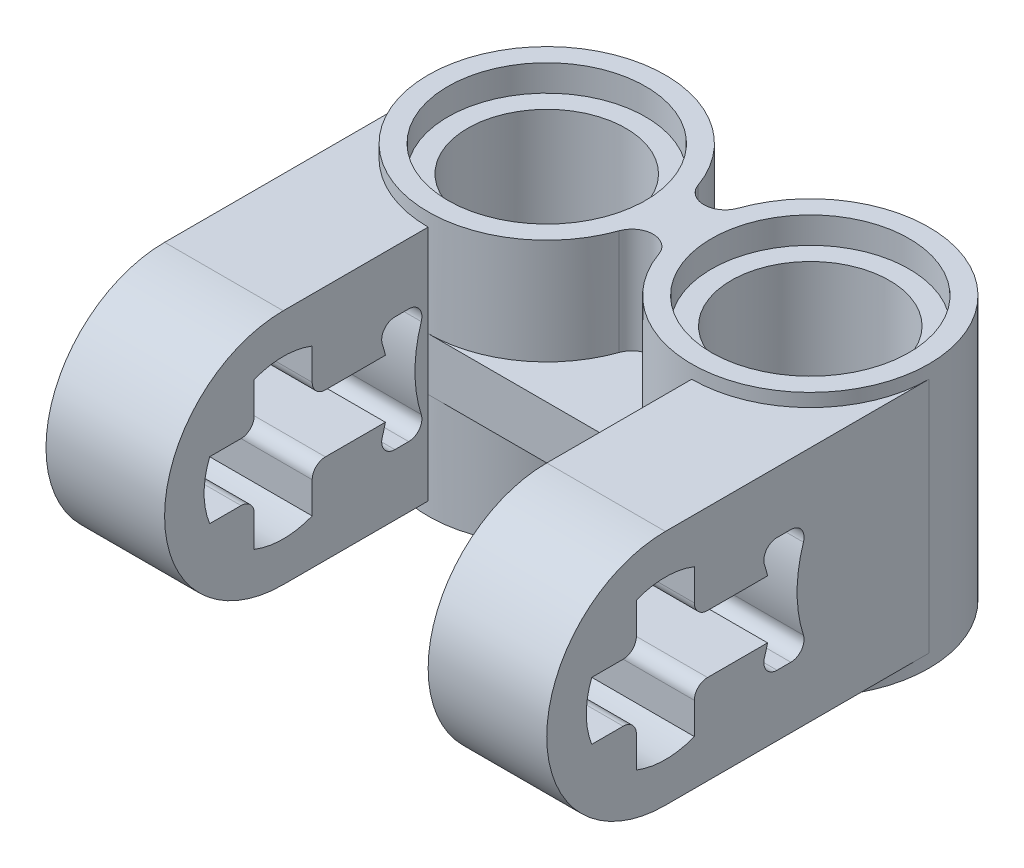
ISO-10303-21;
HEADER;
FILE_DESCRIPTION(('STEP AP214'),'2;1');
FILE_NAME('part.step','',(''),(''),'','','');
FILE_SCHEMA(('AUTOMOTIVE_DESIGN { 1 0 10303 214 1 1 1 1 }'));
ENDSEC;
DATA;
#1=APPLICATION_CONTEXT('core data for automotive mechanical design processes');
#2=APPLICATION_PROTOCOL_DEFINITION('international standard','automotive_design',2000,#1);
#3=PRODUCT_CONTEXT('',#1,'mechanical');
#4=PRODUCT('Part','Part','',(#3));
#5=PRODUCT_RELATED_PRODUCT_CATEGORY('part','',(#4));
#6=PRODUCT_DEFINITION_FORMATION('','',#4);
#7=PRODUCT_DEFINITION_CONTEXT('part definition',#1,'design');
#8=PRODUCT_DEFINITION('design','',#6,#7);
#9=PRODUCT_DEFINITION_SHAPE('','',#8);
#10=(LENGTH_UNIT() NAMED_UNIT(*) SI_UNIT(.MILLI.,.METRE.));
#11=(NAMED_UNIT(*) PLANE_ANGLE_UNIT() SI_UNIT($,.RADIAN.));
#12=(NAMED_UNIT(*) SI_UNIT($,.STERADIAN.) SOLID_ANGLE_UNIT());
#13=UNCERTAINTY_MEASURE_WITH_UNIT(LENGTH_MEASURE(1.E-05),#10,'distance_accuracy_value','');
#14=(GEOMETRIC_REPRESENTATION_CONTEXT(3) GLOBAL_UNCERTAINTY_ASSIGNED_CONTEXT((#13)) GLOBAL_UNIT_ASSIGNED_CONTEXT((#10,
#11,#12)) REPRESENTATION_CONTEXT('',''));
#15=CARTESIAN_POINT('',(0.,0.,0.));
#16=DIRECTION('',(0.,0.,1.));
#17=DIRECTION('',(1.,0.,0.));
#18=AXIS2_PLACEMENT_3D('',#15,#16,#17);
#19=CARTESIAN_POINT('',(11.6,-3.6,8.));
#20=DIRECTION('',(0.,1.,0.));
#21=DIRECTION('',(0.,0.,1.));
#22=AXIS2_PLACEMENT_3D('',#19,#20,#21);
#23=PLANE('',#22);
#24=CARTESIAN_POINT('',(0.,-3.6,0.));
#25=DIRECTION('',(0.,1.,0.));
#26=DIRECTION('',(0.,0.,1.));
#27=AXIS2_PLACEMENT_3D('',#24,#25,#26);
#28=CIRCLE('',#27,3.6);
#29=CARTESIAN_POINT('',(0.,-3.6,3.6));
#30=VERTEX_POINT('',#29);
#31=CARTESIAN_POINT('',(-3.6,-3.6,0.));
#32=VERTEX_POINT('',#31);
#33=EDGE_CURVE('E59',#30,#32,#28,.F.);
#34=ORIENTED_EDGE('',*,*,#33,.F.);
#35=DIRECTION('',(0.,0.,1.));
#36=VECTOR('',#35,1.);
#37=CARTESIAN_POINT('',(0.,-3.6,8.));
#38=LINE('',#37,#36);
#39=CARTESIAN_POINT('',(0.,-3.6,8.));
#40=VERTEX_POINT('',#39);
#41=EDGE_CURVE('E977',#30,#40,#38,.T.);
#42=ORIENTED_EDGE('',*,*,#41,.T.);
#43=DIRECTION('',(-1.,0.,0.));
#44=VECTOR('',#43,1.);
#45=CARTESIAN_POINT('',(11.6,-3.6,8.));
#46=LINE('',#45,#44);
#47=CARTESIAN_POINT('',(-3.6,-3.6,8.));
#48=VERTEX_POINT('',#47);
#49=EDGE_CURVE('E599',#40,#48,#46,.T.);
#50=ORIENTED_EDGE('',*,*,#49,.T.);
#51=DIRECTION('',(0.,0.,-1.));
#52=VECTOR('',#51,1.);
#53=CARTESIAN_POINT('',(-3.6,-3.6,8.));
#54=LINE('',#53,#52);
#55=EDGE_CURVE('E601',#48,#32,#54,.T.);
#56=ORIENTED_EDGE('',*,*,#55,.T.);
#57=EDGE_LOOP('',(#34,#42,#50,#56));
#58=FACE_BOUND('',#57,.T.);
#59=ADVANCED_FACE('F36',(#58),#23,.F.);
#60=CARTESIAN_POINT('',(8.,-3.6,0.));
#61=DIRECTION('',(0.,1.,0.));
#62=DIRECTION('',(0.,0.,1.));
#63=AXIS2_PLACEMENT_3D('',#60,#61,#62);
#64=CIRCLE('',#63,3.6);
#65=CARTESIAN_POINT('',(11.6,-3.6,0.));
#66=VERTEX_POINT('',#65);
#67=CARTESIAN_POINT('',(8.,-3.6,3.6));
#68=VERTEX_POINT('',#67);
#69=EDGE_CURVE('E995',#66,#68,#64,.F.);
#70=ORIENTED_EDGE('',*,*,#69,.F.);
#71=DIRECTION('',(0.,0.,-1.));
#72=VECTOR('',#71,1.);
#73=CARTESIAN_POINT('',(11.6,-3.6,8.));
#74=LINE('',#73,#72);
#75=CARTESIAN_POINT('',(11.6,-3.6,8.));
#76=VERTEX_POINT('',#75);
#77=EDGE_CURVE('E592',#76,#66,#74,.T.);
#78=ORIENTED_EDGE('',*,*,#77,.F.);
#79=CARTESIAN_POINT('',(8.,-3.6,8.));
#80=VERTEX_POINT('',#79);
#81=EDGE_CURVE('E610',#76,#80,#46,.T.);
#82=ORIENTED_EDGE('',*,*,#81,.T.);
#83=DIRECTION('',(0.,0.,1.));
#84=VECTOR('',#83,1.);
#85=CARTESIAN_POINT('',(8.,-3.6,8.));
#86=LINE('',#85,#84);
#87=EDGE_CURVE('E608',#68,#80,#86,.T.);
#88=ORIENTED_EDGE('',*,*,#87,.F.);
#89=EDGE_LOOP('',(#70,#78,#82,#88));
#90=FACE_BOUND('',#89,.T.);
#91=ADVANCED_FACE('F1100',(#90),#23,.F.);
#92=CARTESIAN_POINT('',(11.6,3.6,8.));
#93=DIRECTION('',(0.,-1.,0.));
#94=DIRECTION('',(0.,0.,-1.));
#95=AXIS2_PLACEMENT_3D('',#92,#93,#94);
#96=PLANE('',#95);
#97=DIRECTION('',(0.,0.,1.));
#98=VECTOR('',#97,1.);
#99=CARTESIAN_POINT('',(11.6,3.6,8.));
#100=LINE('',#99,#98);
#101=CARTESIAN_POINT('',(11.6,3.6,0.));
#102=VERTEX_POINT('',#101);
#103=CARTESIAN_POINT('',(11.6,3.6,8.));
#104=VERTEX_POINT('',#103);
#105=EDGE_CURVE('E596',#102,#104,#100,.T.);
#106=ORIENTED_EDGE('',*,*,#105,.F.);
#107=CARTESIAN_POINT('',(8.,3.6,0.));
#108=DIRECTION('',(0.,-1.,0.));
#109=DIRECTION('',(0.,0.,-1.));
#110=AXIS2_PLACEMENT_3D('',#107,#108,#109);
#111=CIRCLE('',#110,3.6);
#112=CARTESIAN_POINT('',(8.,3.6,3.6));
#113=VERTEX_POINT('',#112);
#114=EDGE_CURVE('E993',#102,#113,#111,.T.);
#115=ORIENTED_EDGE('',*,*,#114,.T.);
#116=DIRECTION('',(0.,0.,-1.));
#117=VECTOR('',#116,1.);
#118=CARTESIAN_POINT('',(8.,3.6,8.));
#119=LINE('',#118,#117);
#120=CARTESIAN_POINT('',(8.,3.6,8.));
#121=VERTEX_POINT('',#120);
#122=EDGE_CURVE('E615',#121,#113,#119,.T.);
#123=ORIENTED_EDGE('',*,*,#122,.F.);
#124=DIRECTION('',(-1.,0.,0.));
#125=VECTOR('',#124,1.);
#126=CARTESIAN_POINT('',(11.6,3.6,8.));
#127=LINE('',#126,#125);
#128=EDGE_CURVE('E605',#104,#121,#127,.T.);
#129=ORIENTED_EDGE('',*,*,#128,.F.);
#130=EDGE_LOOP('',(#106,#115,#123,#129));
#131=FACE_BOUND('',#130,.T.);
#132=ADVANCED_FACE('F1105',(#131),#96,.F.);
#133=CARTESIAN_POINT('',(0.,-4.,3.6));
#134=DIRECTION('',(0.,0.,1.));
#135=DIRECTION('',(1.,0.,0.));
#136=AXIS2_PLACEMENT_3D('',#133,#134,#135);
#137=PLANE('',#136);
#138=DIRECTION('',(0.,-1.,0.));
#139=VECTOR('',#138,1.);
#140=CARTESIAN_POINT('',(0.,4.,3.6));
#141=LINE('',#140,#139);
#142=CARTESIAN_POINT('',(0.,0.8,3.6));
#143=VERTEX_POINT('',#142);
#144=CARTESIAN_POINT('',(0.,-0.8,3.6));
#145=VERTEX_POINT('',#144);
#146=EDGE_CURVE('E711',#143,#145,#141,.T.);
#147=ORIENTED_EDGE('',*,*,#146,.T.);
#148=DIRECTION('',(1.,0.,0.));
#149=VECTOR('',#148,1.);
#150=CARTESIAN_POINT('',(8.,-0.8,3.6));
#151=LINE('',#150,#149);
#152=CARTESIAN_POINT('',(8.,-0.8,3.6));
#153=VERTEX_POINT('',#152);
#154=EDGE_CURVE('E918',#145,#153,#151,.T.);
#155=ORIENTED_EDGE('',*,*,#154,.T.);
#156=DIRECTION('',(0.,1.,0.));
#157=VECTOR('',#156,1.);
#158=CARTESIAN_POINT('',(8.,4.,3.6));
#159=LINE('',#158,#157);
#160=CARTESIAN_POINT('',(8.,0.8,3.6));
#161=VERTEX_POINT('',#160);
#162=EDGE_CURVE('E831',#153,#161,#159,.T.);
#163=ORIENTED_EDGE('',*,*,#162,.T.);
#164=DIRECTION('',(1.,0.,0.));
#165=VECTOR('',#164,1.);
#166=CARTESIAN_POINT('',(8.,0.8,3.6));
#167=LINE('',#166,#165);
#168=EDGE_CURVE('E956',#143,#161,#167,.T.);
#169=ORIENTED_EDGE('',*,*,#168,.F.);
#170=EDGE_LOOP('',(#147,#155,#163,#169));
#171=FACE_BOUND('',#170,.T.);
#172=ADVANCED_FACE('F1320',(#171),#137,.T.);
#173=CARTESIAN_POINT('',(0.,-4.,0.));
#174=DIRECTION('',(0.,1.,0.));
#175=DIRECTION('',(0.,0.,1.));
#176=AXIS2_PLACEMENT_3D('',#173,#174,#175);
#177=CYLINDRICAL_SURFACE('',#176,2.4);
#178=CARTESIAN_POINT('',(0.,3.2,0.));
#179=DIRECTION('',(0.,1.,0.));
#180=DIRECTION('',(0.,0.,1.));
#181=AXIS2_PLACEMENT_3D('',#178,#179,#180);
#182=CIRCLE('',#181,2.4);
#183=CARTESIAN_POINT('',(0.,3.2,2.4));
#184=VERTEX_POINT('',#183);
#185=EDGE_CURVE('E916',#184,#184,#182,.F.);
#186=ORIENTED_EDGE('',*,*,#185,.F.);
#187=EDGE_LOOP('',(#186));
#188=FACE_BOUND('',#187,.T.);
#189=CARTESIAN_POINT('',(0.,-3.2,0.));
#190=DIRECTION('',(0.,-1.,0.));
#191=DIRECTION('',(0.,0.,-1.));
#192=AXIS2_PLACEMENT_3D('',#189,#190,#191);
#193=CIRCLE('',#192,2.4);
#194=CARTESIAN_POINT('',(0.,-3.2,-2.4));
#195=VERTEX_POINT('',#194);
#196=EDGE_CURVE('E890',#195,#195,#193,.F.);
#197=ORIENTED_EDGE('',*,*,#196,.F.);
#198=EDGE_LOOP('',(#197));
#199=FACE_BOUND('',#198,.T.);
#200=ADVANCED_FACE('F1316',(#188,#199),#177,.F.);
#201=CARTESIAN_POINT('',(8.,-4.,0.));
#202=DIRECTION('',(0.,1.,0.));
#203=DIRECTION('',(0.,0.,1.));
#204=AXIS2_PLACEMENT_3D('',#201,#202,#203);
#205=CYLINDRICAL_SURFACE('',#204,2.4);
#206=CARTESIAN_POINT('',(8.,3.2,0.));
#207=DIRECTION('',(0.,1.,0.));
#208=DIRECTION('',(0.,0.,1.));
#209=AXIS2_PLACEMENT_3D('',#206,#207,#208);
#210=CIRCLE('',#209,2.4);
#211=CARTESIAN_POINT('',(8.,3.2,2.4));
#212=VERTEX_POINT('',#211);
#213=EDGE_CURVE('E880',#212,#212,#210,.F.);
#214=ORIENTED_EDGE('',*,*,#213,.F.);
#215=EDGE_LOOP('',(#214));
#216=FACE_BOUND('',#215,.T.);
#217=CARTESIAN_POINT('',(8.,-3.2,0.));
#218=DIRECTION('',(0.,-1.,0.));
#219=DIRECTION('',(0.,0.,-1.));
#220=AXIS2_PLACEMENT_3D('',#217,#218,#219);
#221=CIRCLE('',#220,2.4);
#222=CARTESIAN_POINT('',(8.,-3.2,-2.4));
#223=VERTEX_POINT('',#222);
#224=EDGE_CURVE('E868',#223,#223,#221,.F.);
#225=ORIENTED_EDGE('',*,*,#224,.F.);
#226=EDGE_LOOP('',(#225));
#227=FACE_BOUND('',#226,.T.);
#228=ADVANCED_FACE('F1312',(#216,#227),#205,.F.);
#229=CARTESIAN_POINT('',(0.,-4.,-3.6));
#230=DIRECTION('',(0.,0.,-1.));
#231=DIRECTION('',(-1.,0.,0.));
#232=AXIS2_PLACEMENT_3D('',#229,#230,#231);
#233=PLANE('',#232);
#234=DIRECTION('',(0.,1.,0.));
#235=VECTOR('',#234,1.);
#236=CARTESIAN_POINT('',(8.,-4.,-3.6));
#237=LINE('',#236,#235);
#238=CARTESIAN_POINT('',(8.,-0.8,-3.6));
#239=VERTEX_POINT('',#238);
#240=CARTESIAN_POINT('',(8.,0.8,-3.6));
#241=VERTEX_POINT('',#240);
#242=EDGE_CURVE('E974',#239,#241,#237,.T.);
#243=ORIENTED_EDGE('',*,*,#242,.F.);
#244=DIRECTION('',(-1.,0.,0.));
#245=VECTOR('',#244,1.);
#246=CARTESIAN_POINT('',(0.,-0.8,-3.6));
#247=LINE('',#246,#245);
#248=CARTESIAN_POINT('',(0.,-0.8,-3.6));
#249=VERTEX_POINT('',#248);
#250=EDGE_CURVE('E897',#239,#249,#247,.T.);
#251=ORIENTED_EDGE('',*,*,#250,.T.);
#252=DIRECTION('',(0.,1.,0.));
#253=VECTOR('',#252,1.);
#254=CARTESIAN_POINT('',(0.,-4.,-3.6));
#255=LINE('',#254,#253);
#256=CARTESIAN_POINT('',(0.,0.8,-3.6));
#257=VERTEX_POINT('',#256);
#258=EDGE_CURVE('E975',#249,#257,#255,.T.);
#259=ORIENTED_EDGE('',*,*,#258,.T.);
#260=DIRECTION('',(-1.,0.,0.));
#261=VECTOR('',#260,1.);
#262=CARTESIAN_POINT('',(0.,0.8,-3.6));
#263=LINE('',#262,#261);
#264=EDGE_CURVE('E935',#241,#257,#263,.T.);
#265=ORIENTED_EDGE('',*,*,#264,.F.);
#266=EDGE_LOOP('',(#243,#251,#259,#265));
#267=FACE_BOUND('',#266,.T.);
#268=ADVANCED_FACE('F1315',(#267),#233,.T.);
#269=CARTESIAN_POINT('',(0.,-4.,0.));
#270=DIRECTION('',(0.,1.,0.));
#271=DIRECTION('',(0.,0.,1.));
#272=AXIS2_PLACEMENT_3D('',#269,#270,#271);
#273=PLANE('',#272);
#274=CARTESIAN_POINT('',(8.,-4.,0.));
#275=DIRECTION('',(0.,1.,0.));
#276=DIRECTION('',(0.,0.,1.));
#277=AXIS2_PLACEMENT_3D('',#274,#275,#276);
#278=CIRCLE('',#277,3.);
#279=CARTESIAN_POINT('',(8.,-4.,3.));
#280=VERTEX_POINT('',#279);
#281=EDGE_CURVE('E862',#280,#280,#278,.T.);
#282=ORIENTED_EDGE('',*,*,#281,.T.);
#283=EDGE_LOOP('',(#282));
#284=FACE_BOUND('',#283,.T.);
#285=CARTESIAN_POINT('',(0.,-4.,0.));
#286=DIRECTION('',(0.,1.,0.));
#287=DIRECTION('',(0.,0.,1.));
#288=AXIS2_PLACEMENT_3D('',#285,#286,#287);
#289=CIRCLE('',#288,3.);
#290=CARTESIAN_POINT('',(0.,-4.,3.));
#291=VERTEX_POINT('',#290);
#292=EDGE_CURVE('E869',#291,#291,#289,.T.);
#293=ORIENTED_EDGE('',*,*,#292,.T.);
#294=EDGE_LOOP('',(#293));
#295=FACE_BOUND('',#294,.T.);
#296=CARTESIAN_POINT('',(8.,-4.,0.));
#297=DIRECTION('',(0.,1.,0.));
#298=DIRECTION('',(0.,0.,-1.));
#299=AXIS2_PLACEMENT_3D('',#296,#297,#298);
#300=CIRCLE('',#299,3.6);
#301=CARTESIAN_POINT('',(4.60588745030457,-4.,1.2));
#302=VERTEX_POINT('',#301);
#303=CARTESIAN_POINT('',(4.60588745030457,-4.,-1.2));
#304=VERTEX_POINT('',#303);
#305=EDGE_CURVE('E972',#302,#304,#300,.T.);
#306=ORIENTED_EDGE('',*,*,#305,.F.);
#307=CARTESIAN_POINT('',(4.,-4.,1.4142135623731));
#308=DIRECTION('',(0.,-1.,0.));
#309=DIRECTION('',(0.,0.,-1.));
#310=AXIS2_PLACEMENT_3D('',#307,#308,#309);
#311=CIRCLE('',#310,0.642640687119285);
#312=CARTESIAN_POINT('',(3.39411254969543,-4.,1.2));
#313=VERTEX_POINT('',#312);
#314=EDGE_CURVE('E580',#313,#302,#311,.T.);
#315=ORIENTED_EDGE('',*,*,#314,.F.);
#316=CARTESIAN_POINT('',(0.,-4.,0.));
#317=DIRECTION('',(0.,1.,0.));
#318=DIRECTION('',(0.,0.,1.));
#319=AXIS2_PLACEMENT_3D('',#316,#317,#318);
#320=CIRCLE('',#319,3.6);
#321=CARTESIAN_POINT('',(3.39411254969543,-4.,-1.2));
#322=VERTEX_POINT('',#321);
#323=EDGE_CURVE('E969',#322,#313,#320,.T.);
#324=ORIENTED_EDGE('',*,*,#323,.F.);
#325=CARTESIAN_POINT('',(4.,-4.,-1.41421356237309));
#326=DIRECTION('',(0.,1.,0.));
#327=DIRECTION('',(0.,0.,1.));
#328=AXIS2_PLACEMENT_3D('',#325,#326,#327);
#329=CIRCLE('',#328,0.642640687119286);
#330=EDGE_CURVE('E895',#322,#304,#329,.T.);
#331=ORIENTED_EDGE('',*,*,#330,.T.);
#332=EDGE_LOOP('',(#306,#315,#324,#331));
#333=FACE_BOUND('',#332,.T.);
#334=ADVANCED_FACE('F1310',(#284,#295,#333),#273,.F.);
#335=CARTESIAN_POINT('',(0.,4.,0.));
#336=DIRECTION('',(0.,1.,0.));
#337=DIRECTION('',(0.,0.,1.));
#338=AXIS2_PLACEMENT_3D('',#335,#336,#337);
#339=PLANE('',#338);
#340=CARTESIAN_POINT('',(0.,4.,0.));
#341=DIRECTION('',(0.,1.,0.));
#342=DIRECTION('',(0.,0.,1.));
#343=AXIS2_PLACEMENT_3D('',#340,#341,#342);
#344=CIRCLE('',#343,3.);
#345=CARTESIAN_POINT('',(0.,4.,3.));
#346=VERTEX_POINT('',#345);
#347=EDGE_CURVE('E881',#346,#346,#344,.T.);
#348=ORIENTED_EDGE('',*,*,#347,.F.);
#349=EDGE_LOOP('',(#348));
#350=FACE_BOUND('',#349,.T.);
#351=CARTESIAN_POINT('',(8.,4.,0.));
#352=DIRECTION('',(0.,1.,0.));
#353=DIRECTION('',(0.,0.,1.));
#354=AXIS2_PLACEMENT_3D('',#351,#352,#353);
#355=CIRCLE('',#354,3.);
#356=CARTESIAN_POINT('',(8.,4.,3.));
#357=VERTEX_POINT('',#356);
#358=EDGE_CURVE('E887',#357,#357,#355,.T.);
#359=ORIENTED_EDGE('',*,*,#358,.F.);
#360=EDGE_LOOP('',(#359));
#361=FACE_BOUND('',#360,.T.);
#362=CARTESIAN_POINT('',(4.,4.,1.4142135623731));
#363=DIRECTION('',(0.,-1.,0.));
#364=DIRECTION('',(0.,0.,-1.));
#365=AXIS2_PLACEMENT_3D('',#362,#363,#364);
#366=CIRCLE('',#365,0.642640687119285);
#367=CARTESIAN_POINT('',(3.39411254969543,4.,1.2));
#368=VERTEX_POINT('',#367);
#369=CARTESIAN_POINT('',(4.60588745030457,4.,1.2));
#370=VERTEX_POINT('',#369);
#371=EDGE_CURVE('E584',#368,#370,#366,.T.);
#372=ORIENTED_EDGE('',*,*,#371,.T.);
#373=CARTESIAN_POINT('',(8.,4.,0.));
#374=DIRECTION('',(0.,1.,0.));
#375=DIRECTION('',(0.,0.,-1.));
#376=AXIS2_PLACEMENT_3D('',#373,#374,#375);
#377=CIRCLE('',#376,3.6);
#378=CARTESIAN_POINT('',(4.60588745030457,4.,-1.2));
#379=VERTEX_POINT('',#378);
#380=EDGE_CURVE('E967',#370,#379,#377,.T.);
#381=ORIENTED_EDGE('',*,*,#380,.T.);
#382=CARTESIAN_POINT('',(4.,4.,-1.41421356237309));
#383=DIRECTION('',(0.,1.,0.));
#384=DIRECTION('',(0.,0.,1.));
#385=AXIS2_PLACEMENT_3D('',#382,#383,#384);
#386=CIRCLE('',#385,0.642640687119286);
#387=CARTESIAN_POINT('',(3.39411254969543,4.,-1.2));
#388=VERTEX_POINT('',#387);
#389=EDGE_CURVE('E932',#388,#379,#386,.T.);
#390=ORIENTED_EDGE('',*,*,#389,.F.);
#391=CARTESIAN_POINT('',(0.,4.,0.));
#392=DIRECTION('',(0.,1.,0.));
#393=DIRECTION('',(0.,0.,1.));
#394=AXIS2_PLACEMENT_3D('',#391,#392,#393);
#395=CIRCLE('',#394,3.6);
#396=EDGE_CURVE('E948',#388,#368,#395,.T.);
#397=ORIENTED_EDGE('',*,*,#396,.T.);
#398=EDGE_LOOP('',(#372,#381,#390,#397));
#399=FACE_BOUND('',#398,.T.);
#400=ADVANCED_FACE('F1307',(#350,#361,#399),#339,.T.);
#401=CARTESIAN_POINT('',(0.,-4.,0.));
#402=DIRECTION('',(0.,1.,0.));
#403=DIRECTION('',(0.,0.,1.));
#404=AXIS2_PLACEMENT_3D('',#401,#402,#403);
#405=CYLINDRICAL_SURFACE('',#404,3.6);
#406=DIRECTION('',(0.,1.,0.));
#407=VECTOR('',#406,1.);
#408=CARTESIAN_POINT('',(3.39411254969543,0.8,1.2));
#409=LINE('',#408,#407);
#410=CARTESIAN_POINT('',(3.39411254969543,0.8,1.2));
#411=VERTEX_POINT('',#410);
#412=EDGE_CURVE('E962',#411,#368,#409,.T.);
#413=ORIENTED_EDGE('',*,*,#412,.T.);
#414=ORIENTED_EDGE('',*,*,#396,.F.);
#415=DIRECTION('',(0.,1.,0.));
#416=VECTOR('',#415,1.);
#417=CARTESIAN_POINT('',(3.39411254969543,0.8,-1.2));
#418=LINE('',#417,#416);
#419=CARTESIAN_POINT('',(3.39411254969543,0.8,-1.2));
#420=VERTEX_POINT('',#419);
#421=EDGE_CURVE('E945',#420,#388,#418,.T.);
#422=ORIENTED_EDGE('',*,*,#421,.F.);
#423=CARTESIAN_POINT('',(0.,0.8,0.));
#424=DIRECTION('',(0.,-1.,0.));
#425=DIRECTION('',(0.,0.,1.));
#426=AXIS2_PLACEMENT_3D('',#423,#424,#425);
#427=CIRCLE('',#426,3.6);
#428=EDGE_CURVE('E938',#257,#420,#427,.T.);
#429=ORIENTED_EDGE('',*,*,#428,.F.);
#430=ORIENTED_EDGE('',*,*,#258,.F.);
#431=CARTESIAN_POINT('',(0.,-0.8,0.));
#432=DIRECTION('',(0.,-1.,0.));
#433=DIRECTION('',(0.,0.,1.));
#434=AXIS2_PLACEMENT_3D('',#431,#432,#433);
#435=CIRCLE('',#434,3.6);
#436=CARTESIAN_POINT('',(3.39411254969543,-0.8,-1.2));
#437=VERTEX_POINT('',#436);
#438=EDGE_CURVE('E894',#249,#437,#435,.T.);
#439=ORIENTED_EDGE('',*,*,#438,.T.);
#440=DIRECTION('',(0.,-1.,0.));
#441=VECTOR('',#440,1.);
#442=CARTESIAN_POINT('',(3.39411254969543,-0.8,-1.2));
#443=LINE('',#442,#441);
#444=EDGE_CURVE('E902',#437,#322,#443,.T.);
#445=ORIENTED_EDGE('',*,*,#444,.T.);
#446=ORIENTED_EDGE('',*,*,#323,.T.);
#447=DIRECTION('',(0.,-1.,0.));
#448=VECTOR('',#447,1.);
#449=CARTESIAN_POINT('',(3.39411254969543,-0.8,1.2));
#450=LINE('',#449,#448);
#451=CARTESIAN_POINT('',(3.39411254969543,-0.8,1.2));
#452=VERTEX_POINT('',#451);
#453=EDGE_CURVE('E905',#452,#313,#450,.T.);
#454=ORIENTED_EDGE('',*,*,#453,.F.);
#455=CARTESIAN_POINT('',(0.,-0.8,0.));
#456=DIRECTION('',(0.,-1.,0.));
#457=DIRECTION('',(0.,0.,1.));
#458=AXIS2_PLACEMENT_3D('',#455,#456,#457);
#459=CIRCLE('',#458,3.6);
#460=EDGE_CURVE('E921',#452,#145,#459,.T.);
#461=ORIENTED_EDGE('',*,*,#460,.T.);
#462=DIRECTION('',(0.,1.,0.));
#463=VECTOR('',#462,1.);
#464=CARTESIAN_POINT('',(0.,-4.,3.6));
#465=LINE('',#464,#463);
#466=EDGE_CURVE('E741',#30,#145,#465,.T.);
#467=ORIENTED_EDGE('',*,*,#466,.F.);
#468=ORIENTED_EDGE('',*,*,#33,.T.);
#469=DIRECTION('',(0.,1.,0.));
#470=VECTOR('',#469,1.);
#471=CARTESIAN_POINT('',(-3.6,-4.,0.));
#472=LINE('',#471,#470);
#473=CARTESIAN_POINT('',(-3.6,3.6,0.));
#474=VERTEX_POINT('',#473);
#475=EDGE_CURVE('E740',#32,#474,#472,.T.);
#476=ORIENTED_EDGE('',*,*,#475,.T.);
#477=CARTESIAN_POINT('',(0.,3.6,0.));
#478=DIRECTION('',(0.,-1.,0.));
#479=DIRECTION('',(0.,0.,-1.));
#480=AXIS2_PLACEMENT_3D('',#477,#478,#479);
#481=CIRCLE('',#480,3.6);
#482=CARTESIAN_POINT('',(0.,3.6,3.6));
#483=VERTEX_POINT('',#482);
#484=EDGE_CURVE('E587',#474,#483,#481,.F.);
#485=ORIENTED_EDGE('',*,*,#484,.T.);
#486=EDGE_CURVE('E744',#143,#483,#465,.T.);
#487=ORIENTED_EDGE('',*,*,#486,.F.);
#488=CARTESIAN_POINT('',(0.,0.8,0.));
#489=DIRECTION('',(0.,-1.,0.));
#490=DIRECTION('',(0.,0.,1.));
#491=AXIS2_PLACEMENT_3D('',#488,#489,#490);
#492=CIRCLE('',#491,3.6);
#493=EDGE_CURVE('E953',#411,#143,#492,.T.);
#494=ORIENTED_EDGE('',*,*,#493,.F.);
#495=EDGE_LOOP('',(#413,#414,#422,#429,#430,#439,#445,#446,#454,#461,#467,#468,#476,#485,#487,#494));
#496=FACE_BOUND('',#495,.T.);
#497=ADVANCED_FACE('F38',(#496),#405,.T.);
#498=CARTESIAN_POINT('',(8.,-4.,0.));
#499=DIRECTION('',(0.,1.,0.));
#500=DIRECTION('',(0.,0.,1.));
#501=AXIS2_PLACEMENT_3D('',#498,#499,#500);
#502=CYLINDRICAL_SURFACE('',#501,3.6);
#503=DIRECTION('',(0.,-1.,0.));
#504=VECTOR('',#503,1.);
#505=CARTESIAN_POINT('',(4.60588745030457,-0.8,1.2));
#506=LINE('',#505,#504);
#507=CARTESIAN_POINT('',(4.60588745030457,-0.8,1.2));
#508=VERTEX_POINT('',#507);
#509=EDGE_CURVE('E924',#508,#302,#506,.T.);
#510=ORIENTED_EDGE('',*,*,#509,.T.);
#511=ORIENTED_EDGE('',*,*,#305,.T.);
#512=DIRECTION('',(0.,-1.,0.));
#513=VECTOR('',#512,1.);
#514=CARTESIAN_POINT('',(4.60588745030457,-0.8,-1.2));
#515=LINE('',#514,#513);
#516=CARTESIAN_POINT('',(4.60588745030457,-0.8,-1.2));
#517=VERTEX_POINT('',#516);
#518=EDGE_CURVE('E906',#517,#304,#515,.T.);
#519=ORIENTED_EDGE('',*,*,#518,.F.);
#520=CARTESIAN_POINT('',(8.,-0.8,0.));
#521=DIRECTION('',(0.,-1.,0.));
#522=DIRECTION('',(0.,0.,1.));
#523=AXIS2_PLACEMENT_3D('',#520,#521,#522);
#524=CIRCLE('',#523,3.6);
#525=EDGE_CURVE('E900',#517,#239,#524,.T.);
#526=ORIENTED_EDGE('',*,*,#525,.T.);
#527=ORIENTED_EDGE('',*,*,#242,.T.);
#528=CARTESIAN_POINT('',(8.,0.8,0.));
#529=DIRECTION('',(0.,-1.,0.));
#530=DIRECTION('',(0.,0.,1.));
#531=AXIS2_PLACEMENT_3D('',#528,#529,#530);
#532=CIRCLE('',#531,3.6);
#533=CARTESIAN_POINT('',(4.60588745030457,0.8,-1.2));
#534=VERTEX_POINT('',#533);
#535=EDGE_CURVE('E931',#534,#241,#532,.T.);
#536=ORIENTED_EDGE('',*,*,#535,.F.);
#537=DIRECTION('',(0.,1.,0.));
#538=VECTOR('',#537,1.);
#539=CARTESIAN_POINT('',(4.60588745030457,0.8,-1.2));
#540=LINE('',#539,#538);
#541=EDGE_CURVE('E941',#534,#379,#540,.T.);
#542=ORIENTED_EDGE('',*,*,#541,.T.);
#543=ORIENTED_EDGE('',*,*,#380,.F.);
#544=DIRECTION('',(0.,1.,0.));
#545=VECTOR('',#544,1.);
#546=CARTESIAN_POINT('',(4.60588745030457,0.8,1.2));
#547=LINE('',#546,#545);
#548=CARTESIAN_POINT('',(4.60588745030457,0.8,1.2));
#549=VERTEX_POINT('',#548);
#550=EDGE_CURVE('E944',#549,#370,#547,.T.);
#551=ORIENTED_EDGE('',*,*,#550,.F.);
#552=CARTESIAN_POINT('',(8.,0.8,0.));
#553=DIRECTION('',(0.,-1.,0.));
#554=DIRECTION('',(0.,0.,1.));
#555=AXIS2_PLACEMENT_3D('',#552,#553,#554);
#556=CIRCLE('',#555,3.6);
#557=EDGE_CURVE('E959',#161,#549,#556,.T.);
#558=ORIENTED_EDGE('',*,*,#557,.F.);
#559=DIRECTION('',(0.,1.,0.));
#560=VECTOR('',#559,1.);
#561=CARTESIAN_POINT('',(8.,-4.,3.6));
#562=LINE('',#561,#560);
#563=EDGE_CURVE('E858',#161,#113,#562,.T.);
#564=ORIENTED_EDGE('',*,*,#563,.T.);
#565=ORIENTED_EDGE('',*,*,#114,.F.);
#566=DIRECTION('',(0.,1.,0.));
#567=VECTOR('',#566,1.);
#568=CARTESIAN_POINT('',(11.6,-4.,0.));
#569=LINE('',#568,#567);
#570=EDGE_CURVE('E859',#66,#102,#569,.T.);
#571=ORIENTED_EDGE('',*,*,#570,.F.);
#572=ORIENTED_EDGE('',*,*,#69,.T.);
#573=EDGE_CURVE('E863',#68,#153,#562,.T.);
#574=ORIENTED_EDGE('',*,*,#573,.T.);
#575=CARTESIAN_POINT('',(8.,-0.8,0.));
#576=DIRECTION('',(0.,-1.,0.));
#577=DIRECTION('',(0.,0.,1.));
#578=AXIS2_PLACEMENT_3D('',#575,#576,#577);
#579=CIRCLE('',#578,3.6);
#580=EDGE_CURVE('E915',#153,#508,#579,.T.);
#581=ORIENTED_EDGE('',*,*,#580,.T.);
#582=EDGE_LOOP('',(#510,#511,#519,#526,#527,#536,#542,#543,#551,#558,#564,#565,#571,#572,#574,#581));
#583=FACE_BOUND('',#582,.T.);
#584=ADVANCED_FACE('F1305',(#583),#502,.T.);
#585=CARTESIAN_POINT('',(4.,0.8,1.4142135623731));
#586=DIRECTION('',(0.,1.,0.));
#587=DIRECTION('',(0.,0.,1.));
#588=AXIS2_PLACEMENT_3D('',#585,#586,#587);
#589=CYLINDRICAL_SURFACE('',#588,0.642640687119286);
#590=ORIENTED_EDGE('',*,*,#550,.T.);
#591=ORIENTED_EDGE('',*,*,#371,.F.);
#592=ORIENTED_EDGE('',*,*,#412,.F.);
#593=CARTESIAN_POINT('',(4.,0.8,1.4142135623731));
#594=DIRECTION('',(0.,1.,0.));
#595=DIRECTION('',(0.,0.,1.));
#596=AXIS2_PLACEMENT_3D('',#593,#594,#595);
#597=CIRCLE('',#596,0.642640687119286);
#598=EDGE_CURVE('E909',#549,#411,#597,.T.);
#599=ORIENTED_EDGE('',*,*,#598,.F.);
#600=EDGE_LOOP('',(#590,#591,#592,#599));
#601=FACE_BOUND('',#600,.T.);
#602=ADVANCED_FACE('F1301',(#601),#589,.F.);
#603=CARTESIAN_POINT('',(4.,0.8,1.4142135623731));
#604=DIRECTION('',(0.,1.,0.));
#605=DIRECTION('',(0.,0.,1.));
#606=AXIS2_PLACEMENT_3D('',#603,#604,#605);
#607=PLANE('',#606);
#608=ORIENTED_EDGE('',*,*,#598,.T.);
#609=ORIENTED_EDGE('',*,*,#493,.T.);
#610=ORIENTED_EDGE('',*,*,#168,.T.);
#611=ORIENTED_EDGE('',*,*,#557,.T.);
#612=EDGE_LOOP('',(#608,#609,#610,#611));
#613=FACE_BOUND('',#612,.T.);
#614=ADVANCED_FACE('F1297',(#613),#607,.T.);
#615=CARTESIAN_POINT('',(4.,0.8,-1.41421356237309));
#616=DIRECTION('',(0.,1.,0.));
#617=DIRECTION('',(0.,0.,1.));
#618=AXIS2_PLACEMENT_3D('',#615,#616,#617);
#619=CYLINDRICAL_SURFACE('',#618,0.642640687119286);
#620=ORIENTED_EDGE('',*,*,#389,.T.);
#621=ORIENTED_EDGE('',*,*,#541,.F.);
#622=CARTESIAN_POINT('',(4.,0.8,-1.41421356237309));
#623=DIRECTION('',(0.,1.,0.));
#624=DIRECTION('',(0.,0.,1.));
#625=AXIS2_PLACEMENT_3D('',#622,#623,#624);
#626=CIRCLE('',#625,0.642640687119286);
#627=EDGE_CURVE('E928',#420,#534,#626,.T.);
#628=ORIENTED_EDGE('',*,*,#627,.F.);
#629=ORIENTED_EDGE('',*,*,#421,.T.);
#630=EDGE_LOOP('',(#620,#621,#628,#629));
#631=FACE_BOUND('',#630,.T.);
#632=ADVANCED_FACE('F1293',(#631),#619,.F.);
#633=CARTESIAN_POINT('',(4.,0.8,-1.41421356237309));
#634=DIRECTION('',(0.,1.,0.));
#635=DIRECTION('',(0.,0.,1.));
#636=AXIS2_PLACEMENT_3D('',#633,#634,#635);
#637=PLANE('',#636);
#638=ORIENTED_EDGE('',*,*,#627,.T.);
#639=ORIENTED_EDGE('',*,*,#535,.T.);
#640=ORIENTED_EDGE('',*,*,#264,.T.);
#641=ORIENTED_EDGE('',*,*,#428,.T.);
#642=EDGE_LOOP('',(#638,#639,#640,#641));
#643=FACE_BOUND('',#642,.T.);
#644=ADVANCED_FACE('F1289',(#643),#637,.T.);
#645=CARTESIAN_POINT('',(4.,-0.8,1.4142135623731));
#646=DIRECTION('',(0.,-1.,0.));
#647=DIRECTION('',(0.,0.,-1.));
#648=AXIS2_PLACEMENT_3D('',#645,#646,#647);
#649=CYLINDRICAL_SURFACE('',#648,0.642640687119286);
#650=ORIENTED_EDGE('',*,*,#453,.T.);
#651=ORIENTED_EDGE('',*,*,#314,.T.);
#652=ORIENTED_EDGE('',*,*,#509,.F.);
#653=CARTESIAN_POINT('',(4.,-0.8,1.4142135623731));
#654=DIRECTION('',(0.,1.,0.));
#655=DIRECTION('',(0.,0.,1.));
#656=AXIS2_PLACEMENT_3D('',#653,#654,#655);
#657=CIRCLE('',#656,0.642640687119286);
#658=EDGE_CURVE('E912',#508,#452,#657,.T.);
#659=ORIENTED_EDGE('',*,*,#658,.T.);
#660=EDGE_LOOP('',(#650,#651,#652,#659));
#661=FACE_BOUND('',#660,.T.);
#662=ADVANCED_FACE('F1285',(#661),#649,.F.);
#663=CARTESIAN_POINT('',(4.,-0.8,1.4142135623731));
#664=DIRECTION('',(0.,-1.,0.));
#665=DIRECTION('',(0.,0.,1.));
#666=AXIS2_PLACEMENT_3D('',#663,#664,#665);
#667=PLANE('',#666);
#668=ORIENTED_EDGE('',*,*,#658,.F.);
#669=ORIENTED_EDGE('',*,*,#580,.F.);
#670=ORIENTED_EDGE('',*,*,#154,.F.);
#671=ORIENTED_EDGE('',*,*,#460,.F.);
#672=EDGE_LOOP('',(#668,#669,#670,#671));
#673=FACE_BOUND('',#672,.T.);
#674=ADVANCED_FACE('F1281',(#673),#667,.T.);
#675=CARTESIAN_POINT('',(4.,-0.8,-1.41421356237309));
#676=DIRECTION('',(0.,-1.,0.));
#677=DIRECTION('',(0.,0.,-1.));
#678=AXIS2_PLACEMENT_3D('',#675,#676,#677);
#679=CYLINDRICAL_SURFACE('',#678,0.642640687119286);
#680=ORIENTED_EDGE('',*,*,#330,.F.);
#681=ORIENTED_EDGE('',*,*,#444,.F.);
#682=CARTESIAN_POINT('',(4.,-0.8,-1.41421356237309));
#683=DIRECTION('',(0.,1.,0.));
#684=DIRECTION('',(0.,0.,1.));
#685=AXIS2_PLACEMENT_3D('',#682,#683,#684);
#686=CIRCLE('',#685,0.642640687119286);
#687=EDGE_CURVE('E891',#437,#517,#686,.T.);
#688=ORIENTED_EDGE('',*,*,#687,.T.);
#689=ORIENTED_EDGE('',*,*,#518,.T.);
#690=EDGE_LOOP('',(#680,#681,#688,#689));
#691=FACE_BOUND('',#690,.T.);
#692=ADVANCED_FACE('F1277',(#691),#679,.F.);
#693=CARTESIAN_POINT('',(4.,-0.8,-1.41421356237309));
#694=DIRECTION('',(0.,-1.,0.));
#695=DIRECTION('',(0.,0.,1.));
#696=AXIS2_PLACEMENT_3D('',#693,#694,#695);
#697=PLANE('',#696);
#698=ORIENTED_EDGE('',*,*,#687,.F.);
#699=ORIENTED_EDGE('',*,*,#438,.F.);
#700=ORIENTED_EDGE('',*,*,#250,.F.);
#701=ORIENTED_EDGE('',*,*,#525,.F.);
#702=EDGE_LOOP('',(#698,#699,#700,#701));
#703=FACE_BOUND('',#702,.T.);
#704=ADVANCED_FACE('F1270',(#703),#697,.T.);
#705=CARTESIAN_POINT('',(8.,3.2,0.));
#706=DIRECTION('',(0.,1.,0.));
#707=DIRECTION('',(0.,0.,1.));
#708=AXIS2_PLACEMENT_3D('',#705,#706,#707);
#709=PLANE('',#708);
#710=CARTESIAN_POINT('',(8.,3.2,0.));
#711=DIRECTION('',(0.,1.,0.));
#712=DIRECTION('',(0.,0.,1.));
#713=AXIS2_PLACEMENT_3D('',#710,#711,#712);
#714=CIRCLE('',#713,3.);
#715=CARTESIAN_POINT('',(8.,3.2,3.));
#716=VERTEX_POINT('',#715);
#717=EDGE_CURVE('E884',#716,#716,#714,.T.);
#718=ORIENTED_EDGE('',*,*,#717,.T.);
#719=EDGE_LOOP('',(#718));
#720=FACE_BOUND('',#719,.T.);
#721=ORIENTED_EDGE('',*,*,#213,.T.);
#722=EDGE_LOOP('',(#721));
#723=FACE_BOUND('',#722,.T.);
#724=ADVANCED_FACE('F1267',(#720,#723),#709,.T.);
#725=CARTESIAN_POINT('',(8.,3.2,0.));
#726=DIRECTION('',(0.,1.,0.));
#727=DIRECTION('',(0.,0.,1.));
#728=AXIS2_PLACEMENT_3D('',#725,#726,#727);
#729=CYLINDRICAL_SURFACE('',#728,3.);
#730=ORIENTED_EDGE('',*,*,#717,.F.);
#731=EDGE_LOOP('',(#730));
#732=FACE_BOUND('',#731,.T.);
#733=ORIENTED_EDGE('',*,*,#358,.T.);
#734=EDGE_LOOP('',(#733));
#735=FACE_BOUND('',#734,.T.);
#736=ADVANCED_FACE('F1262',(#732,#735),#729,.F.);
#737=CARTESIAN_POINT('',(0.,3.2,0.));
#738=DIRECTION('',(0.,1.,0.));
#739=DIRECTION('',(0.,0.,1.));
#740=AXIS2_PLACEMENT_3D('',#737,#738,#739);
#741=PLANE('',#740);
#742=CARTESIAN_POINT('',(0.,3.2,0.));
#743=DIRECTION('',(0.,1.,0.));
#744=DIRECTION('',(0.,0.,1.));
#745=AXIS2_PLACEMENT_3D('',#742,#743,#744);
#746=CIRCLE('',#745,3.);
#747=CARTESIAN_POINT('',(0.,3.2,3.));
#748=VERTEX_POINT('',#747);
#749=EDGE_CURVE('E877',#748,#748,#746,.T.);
#750=ORIENTED_EDGE('',*,*,#749,.T.);
#751=EDGE_LOOP('',(#750));
#752=FACE_BOUND('',#751,.T.);
#753=ORIENTED_EDGE('',*,*,#185,.T.);
#754=EDGE_LOOP('',(#753));
#755=FACE_BOUND('',#754,.T.);
#756=ADVANCED_FACE('F1259',(#752,#755),#741,.T.);
#757=CARTESIAN_POINT('',(0.,3.2,0.));
#758=DIRECTION('',(0.,1.,0.));
#759=DIRECTION('',(0.,0.,1.));
#760=AXIS2_PLACEMENT_3D('',#757,#758,#759);
#761=CYLINDRICAL_SURFACE('',#760,3.);
#762=ORIENTED_EDGE('',*,*,#749,.F.);
#763=EDGE_LOOP('',(#762));
#764=FACE_BOUND('',#763,.T.);
#765=ORIENTED_EDGE('',*,*,#347,.T.);
#766=EDGE_LOOP('',(#765));
#767=FACE_BOUND('',#766,.T.);
#768=ADVANCED_FACE('F1254',(#764,#767),#761,.F.);
#769=CARTESIAN_POINT('',(8.,-3.2,0.));
#770=DIRECTION('',(0.,-1.,0.));
#771=DIRECTION('',(0.,0.,1.));
#772=AXIS2_PLACEMENT_3D('',#769,#770,#771);
#773=PLANE('',#772);
#774=CARTESIAN_POINT('',(8.,-3.2,0.));
#775=DIRECTION('',(0.,1.,0.));
#776=DIRECTION('',(0.,0.,1.));
#777=AXIS2_PLACEMENT_3D('',#774,#775,#776);
#778=CIRCLE('',#777,3.);
#779=CARTESIAN_POINT('',(8.,-3.2,3.));
#780=VERTEX_POINT('',#779);
#781=EDGE_CURVE('E872',#780,#780,#778,.T.);
#782=ORIENTED_EDGE('',*,*,#781,.F.);
#783=EDGE_LOOP('',(#782));
#784=FACE_BOUND('',#783,.T.);
#785=ORIENTED_EDGE('',*,*,#224,.T.);
#786=EDGE_LOOP('',(#785));
#787=FACE_BOUND('',#786,.T.);
#788=ADVANCED_FACE('F1251',(#784,#787),#773,.T.);
#789=CARTESIAN_POINT('',(8.,-3.2,0.));
#790=DIRECTION('',(0.,-1.,0.));
#791=DIRECTION('',(0.,0.,-1.));
#792=AXIS2_PLACEMENT_3D('',#789,#790,#791);
#793=CYLINDRICAL_SURFACE('',#792,3.);
#794=ORIENTED_EDGE('',*,*,#781,.T.);
#795=EDGE_LOOP('',(#794));
#796=FACE_BOUND('',#795,.T.);
#797=ORIENTED_EDGE('',*,*,#281,.F.);
#798=EDGE_LOOP('',(#797));
#799=FACE_BOUND('',#798,.T.);
#800=ADVANCED_FACE('F1246',(#796,#799),#793,.F.);
#801=CARTESIAN_POINT('',(0.,-3.2,0.));
#802=DIRECTION('',(0.,-1.,0.));
#803=DIRECTION('',(0.,0.,1.));
#804=AXIS2_PLACEMENT_3D('',#801,#802,#803);
#805=PLANE('',#804);
#806=CARTESIAN_POINT('',(0.,-3.2,0.));
#807=DIRECTION('',(0.,1.,0.));
#808=DIRECTION('',(0.,0.,1.));
#809=AXIS2_PLACEMENT_3D('',#806,#807,#808);
#810=CIRCLE('',#809,3.);
#811=CARTESIAN_POINT('',(0.,-3.2,3.));
#812=VERTEX_POINT('',#811);
#813=EDGE_CURVE('E865',#812,#812,#810,.T.);
#814=ORIENTED_EDGE('',*,*,#813,.F.);
#815=EDGE_LOOP('',(#814));
#816=FACE_BOUND('',#815,.T.);
#817=ORIENTED_EDGE('',*,*,#196,.T.);
#818=EDGE_LOOP('',(#817));
#819=FACE_BOUND('',#818,.T.);
#820=ADVANCED_FACE('F1243',(#816,#819),#805,.T.);
#821=CARTESIAN_POINT('',(0.,-3.2,0.));
#822=DIRECTION('',(0.,-1.,0.));
#823=DIRECTION('',(0.,0.,-1.));
#824=AXIS2_PLACEMENT_3D('',#821,#822,#823);
#825=CYLINDRICAL_SURFACE('',#824,3.);
#826=ORIENTED_EDGE('',*,*,#813,.T.);
#827=EDGE_LOOP('',(#826));
#828=FACE_BOUND('',#827,.T.);
#829=ORIENTED_EDGE('',*,*,#292,.F.);
#830=EDGE_LOOP('',(#829));
#831=FACE_BOUND('',#830,.T.);
#832=ADVANCED_FACE('F1242',(#828,#831),#825,.F.);
#833=CARTESIAN_POINT('',(11.6,-4.,3.6));
#834=DIRECTION('',(1.,0.,0.));
#835=DIRECTION('',(0.,0.,-1.));
#836=AXIS2_PLACEMENT_3D('',#833,#834,#835);
#837=PLANE('',#836);
#838=CARTESIAN_POINT('',(11.6,0.,8.8));
#839=DIRECTION('',(1.,0.,0.));
#840=DIRECTION('',(0.,0.,-1.));
#841=AXIS2_PLACEMENT_3D('',#838,#839,#840);
#842=CIRCLE('',#841,4.);
#843=CARTESIAN_POINT('',(11.6,-1.22141779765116,4.991044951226));
#844=VERTEX_POINT('',#843);
#845=CARTESIAN_POINT('',(11.6,-0.880000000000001,4.8980005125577));
#846=VERTEX_POINT('',#845);
#847=EDGE_CURVE('E478',#844,#846,#842,.T.);
#848=ORIENTED_EDGE('',*,*,#847,.T.);
#849=DIRECTION('',(0.,0.,-1.));
#850=VECTOR('',#849,1.);
#851=CARTESIAN_POINT('',(11.6,-0.88,6.72));
#852=LINE('',#851,#850);
#853=CARTESIAN_POINT('',(11.6,-0.88,6.72));
#854=VERTEX_POINT('',#853);
#855=EDGE_CURVE('E461',#854,#846,#852,.T.);
#856=ORIENTED_EDGE('',*,*,#855,.F.);
#857=CARTESIAN_POINT('',(11.6,-1.28,6.72));
#858=DIRECTION('',(-1.,0.,0.));
#859=DIRECTION('',(0.,0.,1.));
#860=AXIS2_PLACEMENT_3D('',#857,#858,#859);
#861=CIRCLE('',#860,0.400000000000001);
#862=CARTESIAN_POINT('',(11.6,-1.28,7.12));
#863=VERTEX_POINT('',#862);
#864=EDGE_CURVE('E472',#863,#854,#861,.T.);
#865=ORIENTED_EDGE('',*,*,#864,.F.);
#866=DIRECTION('',(0.,1.,0.));
#867=VECTOR('',#866,1.);
#868=CARTESIAN_POINT('',(11.6,-2.23284571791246,7.12));
#869=LINE('',#868,#867);
#870=CARTESIAN_POINT('',(11.6,-2.23284571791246,7.12));
#871=VERTEX_POINT('',#870);
#872=EDGE_CURVE('E818',#871,#863,#869,.T.);
#873=ORIENTED_EDGE('',*,*,#872,.F.);
#874=CARTESIAN_POINT('',(11.6,0.,8.));
#875=DIRECTION('',(1.,0.,0.));
#876=DIRECTION('',(0.,0.,-1.));
#877=AXIS2_PLACEMENT_3D('',#874,#875,#876);
#878=CIRCLE('',#877,2.4);
#879=CARTESIAN_POINT('',(11.6,-2.23284571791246,8.88));
#880=VERTEX_POINT('',#879);
#881=EDGE_CURVE('E815',#880,#871,#878,.T.);
#882=ORIENTED_EDGE('',*,*,#881,.F.);
#883=DIRECTION('',(0.,-1.,0.));
#884=VECTOR('',#883,1.);
#885=CARTESIAN_POINT('',(11.6,-1.28,8.88));
#886=LINE('',#885,#884);
#887=CARTESIAN_POINT('',(11.6,-1.28,8.88));
#888=VERTEX_POINT('',#887);
#889=EDGE_CURVE('E812',#888,#880,#886,.T.);
#890=ORIENTED_EDGE('',*,*,#889,.F.);
#891=CARTESIAN_POINT('',(11.6,-1.28,9.28));
#892=DIRECTION('',(-1.,0.,0.));
#893=DIRECTION('',(0.,0.,-1.));
#894=AXIS2_PLACEMENT_3D('',#891,#892,#893);
#895=CIRCLE('',#894,0.4);
#896=CARTESIAN_POINT('',(11.6,-0.88,9.28));
#897=VERTEX_POINT('',#896);
#898=EDGE_CURVE('E809',#897,#888,#895,.T.);
#899=ORIENTED_EDGE('',*,*,#898,.F.);
#900=DIRECTION('',(0.,0.,-1.));
#901=VECTOR('',#900,1.);
#902=CARTESIAN_POINT('',(11.6,-0.88,10.2328457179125));
#903=LINE('',#902,#901);
#904=CARTESIAN_POINT('',(11.6,-0.88,10.2328457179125));
#905=VERTEX_POINT('',#904);
#906=EDGE_CURVE('E806',#905,#897,#903,.T.);
#907=ORIENTED_EDGE('',*,*,#906,.F.);
#908=CARTESIAN_POINT('',(11.6,0.,8.));
#909=DIRECTION('',(1.,0.,0.));
#910=DIRECTION('',(0.,0.,-1.));
#911=AXIS2_PLACEMENT_3D('',#908,#909,#910);
#912=CIRCLE('',#911,2.4);
#913=CARTESIAN_POINT('',(11.6,0.879999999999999,10.2328457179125));
#914=VERTEX_POINT('',#913);
#915=EDGE_CURVE('E803',#914,#905,#912,.T.);
#916=ORIENTED_EDGE('',*,*,#915,.F.);
#917=DIRECTION('',(0.,0.,1.));
#918=VECTOR('',#917,1.);
#919=CARTESIAN_POINT('',(11.6,0.88,9.28));
#920=LINE('',#919,#918);
#921=CARTESIAN_POINT('',(11.6,0.88,9.28));
#922=VERTEX_POINT('',#921);
#923=EDGE_CURVE('E800',#922,#914,#920,.T.);
#924=ORIENTED_EDGE('',*,*,#923,.F.);
#925=CARTESIAN_POINT('',(11.6,1.28,9.28));
#926=DIRECTION('',(-1.,0.,0.));
#927=DIRECTION('',(0.,0.,-1.));
#928=AXIS2_PLACEMENT_3D('',#925,#926,#927);
#929=CIRCLE('',#928,0.399999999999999);
#930=CARTESIAN_POINT('',(11.6,1.28,8.88));
#931=VERTEX_POINT('',#930);
#932=EDGE_CURVE('E797',#931,#922,#929,.T.);
#933=ORIENTED_EDGE('',*,*,#932,.F.);
#934=DIRECTION('',(0.,-1.,0.));
#935=VECTOR('',#934,1.);
#936=CARTESIAN_POINT('',(11.6,2.23284571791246,8.88));
#937=LINE('',#936,#935);
#938=CARTESIAN_POINT('',(11.6,2.23284571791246,8.88));
#939=VERTEX_POINT('',#938);
#940=EDGE_CURVE('E794',#939,#931,#937,.T.);
#941=ORIENTED_EDGE('',*,*,#940,.F.);
#942=CARTESIAN_POINT('',(11.6,0.,8.));
#943=DIRECTION('',(1.,0.,0.));
#944=DIRECTION('',(0.,0.,-1.));
#945=AXIS2_PLACEMENT_3D('',#942,#943,#944);
#946=CIRCLE('',#945,2.4);
#947=CARTESIAN_POINT('',(11.6,2.23284571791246,7.12));
#948=VERTEX_POINT('',#947);
#949=EDGE_CURVE('E743',#948,#939,#946,.T.);
#950=ORIENTED_EDGE('',*,*,#949,.F.);
#951=DIRECTION('',(0.,1.,0.));
#952=VECTOR('',#951,1.);
#953=CARTESIAN_POINT('',(11.6,1.28,7.12));
#954=LINE('',#953,#952);
#955=CARTESIAN_POINT('',(11.6,1.28,7.12));
#956=VERTEX_POINT('',#955);
#957=EDGE_CURVE('E751',#956,#948,#954,.T.);
#958=ORIENTED_EDGE('',*,*,#957,.F.);
#959=CARTESIAN_POINT('',(11.6,1.28,6.72));
#960=DIRECTION('',(-1.,0.,0.));
#961=DIRECTION('',(0.,0.,1.));
#962=AXIS2_PLACEMENT_3D('',#959,#960,#961);
#963=CIRCLE('',#962,0.4);
#964=CARTESIAN_POINT('',(11.6,0.88,6.72));
#965=VERTEX_POINT('',#964);
#966=EDGE_CURVE('E824',#965,#956,#963,.T.);
#967=ORIENTED_EDGE('',*,*,#966,.F.);
#968=DIRECTION('',(0.,0.,1.));
#969=VECTOR('',#968,1.);
#970=CARTESIAN_POINT('',(11.6,0.88,5.76715428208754));
#971=LINE('',#970,#969);
#972=CARTESIAN_POINT('',(11.6,0.88,4.8980005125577));
#973=VERTEX_POINT('',#972);
#974=EDGE_CURVE('E471',#973,#965,#971,.T.);
#975=ORIENTED_EDGE('',*,*,#974,.F.);
#976=CARTESIAN_POINT('',(11.6,0.,8.8));
#977=DIRECTION('',(1.,0.,0.));
#978=DIRECTION('',(0.,0.,-1.));
#979=AXIS2_PLACEMENT_3D('',#976,#977,#978);
#980=CIRCLE('',#979,4.);
#981=CARTESIAN_POINT('',(11.6,1.22141779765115,4.991044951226));
#982=VERTEX_POINT('',#981);
#983=EDGE_CURVE('E532',#973,#982,#980,.T.);
#984=ORIENTED_EDGE('',*,*,#983,.T.);
#985=CARTESIAN_POINT('',(11.6,1.34355957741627,4.6101494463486));
#986=DIRECTION('',(1.,0.,0.));
#987=DIRECTION('',(0.,0.,-1.));
#988=AXIS2_PLACEMENT_3D('',#985,#986,#987);
#989=CIRCLE('',#988,0.4);
#990=CARTESIAN_POINT('',(11.6,1.74355957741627,4.6101494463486));
#991=VERTEX_POINT('',#990);
#992=EDGE_CURVE('E527',#982,#991,#989,.F.);
#993=ORIENTED_EDGE('',*,*,#992,.T.);
#994=DIRECTION('',(0.,0.,-1.));
#995=VECTOR('',#994,1.);
#996=CARTESIAN_POINT('',(11.6,1.74355957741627,4.18985055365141));
#997=LINE('',#996,#995);
#998=CARTESIAN_POINT('',(11.6,1.74355957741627,4.18985055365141));
#999=VERTEX_POINT('',#998);
#1000=EDGE_CURVE('E522',#991,#999,#997,.T.);
#1001=ORIENTED_EDGE('',*,*,#1000,.T.);
#1002=CARTESIAN_POINT('',(11.6,1.34355957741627,4.18985055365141));
#1003=DIRECTION('',(1.,0.,0.));
#1004=DIRECTION('',(0.,0.,-1.));
#1005=AXIS2_PLACEMENT_3D('',#1002,#1003,#1004);
#1006=CIRCLE('',#1005,0.4);
#1007=CARTESIAN_POINT('',(11.6,1.22141779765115,3.80895504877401));
#1008=VERTEX_POINT('',#1007);
#1009=EDGE_CURVE('E517',#999,#1008,#1006,.F.);
#1010=ORIENTED_EDGE('',*,*,#1009,.T.);
#1011=CARTESIAN_POINT('',(11.6,0.,0.));
#1012=DIRECTION('',(1.,0.,0.));
#1013=DIRECTION('',(0.,0.,-1.));
#1014=AXIS2_PLACEMENT_3D('',#1011,#1012,#1013);
#1015=CIRCLE('',#1014,4.);
#1016=CARTESIAN_POINT('',(11.6,-1.22141779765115,3.80895504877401));
#1017=VERTEX_POINT('',#1016);
#1018=EDGE_CURVE('E512',#1008,#1017,#1015,.T.);
#1019=ORIENTED_EDGE('',*,*,#1018,.T.);
#1020=CARTESIAN_POINT('',(11.6,-1.34355957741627,4.18985055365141));
#1021=DIRECTION('',(1.,0.,0.));
#1022=DIRECTION('',(0.,0.,-1.));
#1023=AXIS2_PLACEMENT_3D('',#1020,#1021,#1022);
#1024=CIRCLE('',#1023,0.4);
#1025=CARTESIAN_POINT('',(11.6,-1.74355957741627,4.18985055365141));
#1026=VERTEX_POINT('',#1025);
#1027=EDGE_CURVE('E507',#1017,#1026,#1024,.F.);
#1028=ORIENTED_EDGE('',*,*,#1027,.T.);
#1029=DIRECTION('',(0.,0.,1.));
#1030=VECTOR('',#1029,1.);
#1031=CARTESIAN_POINT('',(11.6,-1.74355957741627,4.18985055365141));
#1032=LINE('',#1031,#1030);
#1033=CARTESIAN_POINT('',(11.6,-1.74355957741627,4.61014944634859));
#1034=VERTEX_POINT('',#1033);
#1035=EDGE_CURVE('E503',#1026,#1034,#1032,.T.);
#1036=ORIENTED_EDGE('',*,*,#1035,.T.);
#1037=CARTESIAN_POINT('',(11.6,-1.34355957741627,4.61014944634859));
#1038=DIRECTION('',(1.,0.,0.));
#1039=DIRECTION('',(0.,0.,-1.));
#1040=AXIS2_PLACEMENT_3D('',#1037,#1038,#1039);
#1041=CIRCLE('',#1040,0.4);
#1042=EDGE_CURVE('E489',#1034,#844,#1041,.F.);
#1043=ORIENTED_EDGE('',*,*,#1042,.T.);
#1044=EDGE_LOOP('',(#848,#856,#865,#873,#882,#890,#899,#907,#916,#924,#933,#941,#950,#958,#967,
#975,#984,#993,#1001,#1010,#1019,#1028,#1036,#1043));
#1045=FACE_BOUND('',#1044,.T.);
#1046=ORIENTED_EDGE('',*,*,#105,.T.);
#1047=CARTESIAN_POINT('',(11.6,0.,8.));
#1048=DIRECTION('',(1.,0.,0.));
#1049=DIRECTION('',(0.,0.,1.));
#1050=AXIS2_PLACEMENT_3D('',#1047,#1048,#1049);
#1051=CIRCLE('',#1050,3.6);
#1052=EDGE_CURVE('E589',#104,#76,#1051,.T.);
#1053=ORIENTED_EDGE('',*,*,#1052,.T.);
#1054=ORIENTED_EDGE('',*,*,#77,.T.);
#1055=ORIENTED_EDGE('',*,*,#570,.T.);
#1056=EDGE_LOOP('',(#1046,#1053,#1054,#1055));
#1057=FACE_BOUND('',#1056,.T.);
#1058=ADVANCED_FACE('F486',(#1045,#1057),#837,.T.);
#1059=CARTESIAN_POINT('',(8.,0.,8.));
#1060=DIRECTION('',(1.,0.,0.));
#1061=DIRECTION('',(0.,0.,-1.));
#1062=AXIS2_PLACEMENT_3D('',#1059,#1060,#1061);
#1063=PLANE('',#1062);
#1064=DIRECTION('',(0.,0.,-1.));
#1065=VECTOR('',#1064,1.);
#1066=CARTESIAN_POINT('',(8.,-0.88,6.72));
#1067=LINE('',#1066,#1065);
#1068=CARTESIAN_POINT('',(8.,-0.88,6.72));
#1069=VERTEX_POINT('',#1068);
#1070=CARTESIAN_POINT('',(8.,-0.880000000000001,4.8980005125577));
#1071=VERTEX_POINT('',#1070);
#1072=EDGE_CURVE('E781',#1069,#1071,#1067,.T.);
#1073=ORIENTED_EDGE('',*,*,#1072,.T.);
#1074=CARTESIAN_POINT('',(8.,0.,8.8));
#1075=DIRECTION('',(1.,0.,0.));
#1076=DIRECTION('',(0.,0.,-1.));
#1077=AXIS2_PLACEMENT_3D('',#1074,#1075,#1076);
#1078=CIRCLE('',#1077,4.);
#1079=CARTESIAN_POINT('',(8.,-1.22141779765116,4.991044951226));
#1080=VERTEX_POINT('',#1079);
#1081=EDGE_CURVE('E481',#1071,#1080,#1078,.F.);
#1082=ORIENTED_EDGE('',*,*,#1081,.T.);
#1083=CARTESIAN_POINT('',(8.,-1.34355957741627,4.61014944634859));
#1084=DIRECTION('',(1.,0.,0.));
#1085=DIRECTION('',(0.,0.,-1.));
#1086=AXIS2_PLACEMENT_3D('',#1083,#1084,#1085);
#1087=CIRCLE('',#1086,0.4);
#1088=CARTESIAN_POINT('',(8.,-1.74355957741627,4.61014944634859));
#1089=VERTEX_POINT('',#1088);
#1090=EDGE_CURVE('E555',#1080,#1089,#1087,.T.);
#1091=ORIENTED_EDGE('',*,*,#1090,.T.);
#1092=DIRECTION('',(0.,0.,-1.));
#1093=VECTOR('',#1092,1.);
#1094=CARTESIAN_POINT('',(8.,-1.74355957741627,8.));
#1095=LINE('',#1094,#1093);
#1096=CARTESIAN_POINT('',(8.,-1.74355957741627,4.18985055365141));
#1097=VERTEX_POINT('',#1096);
#1098=EDGE_CURVE('E558',#1089,#1097,#1095,.T.);
#1099=ORIENTED_EDGE('',*,*,#1098,.T.);
#1100=CARTESIAN_POINT('',(8.,-1.34355957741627,4.18985055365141));
#1101=DIRECTION('',(1.,0.,0.));
#1102=DIRECTION('',(0.,0.,-1.));
#1103=AXIS2_PLACEMENT_3D('',#1100,#1101,#1102);
#1104=CIRCLE('',#1103,0.4);
#1105=CARTESIAN_POINT('',(8.,-1.22141779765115,3.80895504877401));
#1106=VERTEX_POINT('',#1105);
#1107=EDGE_CURVE('E561',#1097,#1106,#1104,.T.);
#1108=ORIENTED_EDGE('',*,*,#1107,.T.);
#1109=CARTESIAN_POINT('',(8.,0.,0.));
#1110=DIRECTION('',(1.,0.,0.));
#1111=DIRECTION('',(0.,0.,-1.));
#1112=AXIS2_PLACEMENT_3D('',#1109,#1110,#1111);
#1113=CIRCLE('',#1112,4.);
#1114=CARTESIAN_POINT('',(8.,1.22141779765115,3.80895504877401));
#1115=VERTEX_POINT('',#1114);
#1116=EDGE_CURVE('E564',#1106,#1115,#1113,.F.);
#1117=ORIENTED_EDGE('',*,*,#1116,.T.);
#1118=CARTESIAN_POINT('',(8.,1.34355957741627,4.18985055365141));
#1119=DIRECTION('',(1.,0.,0.));
#1120=DIRECTION('',(0.,0.,-1.));
#1121=AXIS2_PLACEMENT_3D('',#1118,#1119,#1120);
#1122=CIRCLE('',#1121,0.4);
#1123=CARTESIAN_POINT('',(8.,1.74355957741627,4.18985055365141));
#1124=VERTEX_POINT('',#1123);
#1125=EDGE_CURVE('E567',#1115,#1124,#1122,.T.);
#1126=ORIENTED_EDGE('',*,*,#1125,.T.);
#1127=DIRECTION('',(0.,0.,1.));
#1128=VECTOR('',#1127,1.);
#1129=CARTESIAN_POINT('',(8.,1.74355957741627,8.));
#1130=LINE('',#1129,#1128);
#1131=CARTESIAN_POINT('',(8.,1.74355957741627,4.6101494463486));
#1132=VERTEX_POINT('',#1131);
#1133=EDGE_CURVE('E570',#1124,#1132,#1130,.T.);
#1134=ORIENTED_EDGE('',*,*,#1133,.T.);
#1135=CARTESIAN_POINT('',(8.,1.34355957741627,4.6101494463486));
#1136=DIRECTION('',(1.,0.,0.));
#1137=DIRECTION('',(0.,0.,-1.));
#1138=AXIS2_PLACEMENT_3D('',#1135,#1136,#1137);
#1139=CIRCLE('',#1138,0.4);
#1140=CARTESIAN_POINT('',(8.,1.22141779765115,4.991044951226));
#1141=VERTEX_POINT('',#1140);
#1142=EDGE_CURVE('E573',#1132,#1141,#1139,.T.);
#1143=ORIENTED_EDGE('',*,*,#1142,.T.);
#1144=CARTESIAN_POINT('',(8.,0.,8.8));
#1145=DIRECTION('',(1.,0.,0.));
#1146=DIRECTION('',(0.,0.,-1.));
#1147=AXIS2_PLACEMENT_3D('',#1144,#1145,#1146);
#1148=CIRCLE('',#1147,4.);
#1149=CARTESIAN_POINT('',(8.,0.88,4.8980005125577));
#1150=VERTEX_POINT('',#1149);
#1151=EDGE_CURVE('E576',#1141,#1150,#1148,.F.);
#1152=ORIENTED_EDGE('',*,*,#1151,.T.);
#1153=DIRECTION('',(0.,0.,1.));
#1154=VECTOR('',#1153,1.);
#1155=CARTESIAN_POINT('',(8.,0.88,5.76715428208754));
#1156=LINE('',#1155,#1154);
#1157=CARTESIAN_POINT('',(8.,0.88,6.72));
#1158=VERTEX_POINT('',#1157);
#1159=EDGE_CURVE('E783',#1150,#1158,#1156,.T.);
#1160=ORIENTED_EDGE('',*,*,#1159,.T.);
#1161=CARTESIAN_POINT('',(8.,1.28,6.72));
#1162=DIRECTION('',(-1.,0.,0.));
#1163=DIRECTION('',(0.,0.,1.));
#1164=AXIS2_PLACEMENT_3D('',#1161,#1162,#1163);
#1165=CIRCLE('',#1164,0.4);
#1166=CARTESIAN_POINT('',(8.,1.28,7.12));
#1167=VERTEX_POINT('',#1166);
#1168=EDGE_CURVE('E786',#1158,#1167,#1165,.T.);
#1169=ORIENTED_EDGE('',*,*,#1168,.T.);
#1170=DIRECTION('',(0.,1.,0.));
#1171=VECTOR('',#1170,1.);
#1172=CARTESIAN_POINT('',(8.,1.28,7.12));
#1173=LINE('',#1172,#1171);
#1174=CARTESIAN_POINT('',(8.,2.23284571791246,7.12));
#1175=VERTEX_POINT('',#1174);
#1176=EDGE_CURVE('E789',#1167,#1175,#1173,.T.);
#1177=ORIENTED_EDGE('',*,*,#1176,.T.);
#1178=CARTESIAN_POINT('',(8.,0.,8.));
#1179=DIRECTION('',(1.,0.,0.));
#1180=DIRECTION('',(0.,0.,-1.));
#1181=AXIS2_PLACEMENT_3D('',#1178,#1179,#1180);
#1182=CIRCLE('',#1181,2.4);
#1183=CARTESIAN_POINT('',(8.,2.23284571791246,8.88));
#1184=VERTEX_POINT('',#1183);
#1185=EDGE_CURVE('E747',#1175,#1184,#1182,.T.);
#1186=ORIENTED_EDGE('',*,*,#1185,.T.);
#1187=DIRECTION('',(0.,-1.,0.));
#1188=VECTOR('',#1187,1.);
#1189=CARTESIAN_POINT('',(8.,2.23284571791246,8.88));
#1190=LINE('',#1189,#1188);
#1191=CARTESIAN_POINT('',(8.,1.28,8.88));
#1192=VERTEX_POINT('',#1191);
#1193=EDGE_CURVE('E750',#1184,#1192,#1190,.T.);
#1194=ORIENTED_EDGE('',*,*,#1193,.T.);
#1195=CARTESIAN_POINT('',(8.,1.28,9.28));
#1196=DIRECTION('',(-1.,0.,0.));
#1197=DIRECTION('',(0.,0.,-1.));
#1198=AXIS2_PLACEMENT_3D('',#1195,#1196,#1197);
#1199=CIRCLE('',#1198,0.399999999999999);
#1200=CARTESIAN_POINT('',(8.,0.88,9.28));
#1201=VERTEX_POINT('',#1200);
#1202=EDGE_CURVE('E754',#1192,#1201,#1199,.T.);
#1203=ORIENTED_EDGE('',*,*,#1202,.T.);
#1204=DIRECTION('',(0.,0.,1.));
#1205=VECTOR('',#1204,1.);
#1206=CARTESIAN_POINT('',(8.,0.88,9.28));
#1207=LINE('',#1206,#1205);
#1208=CARTESIAN_POINT('',(8.,0.879999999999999,10.2328457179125));
#1209=VERTEX_POINT('',#1208);
#1210=EDGE_CURVE('E757',#1201,#1209,#1207,.T.);
#1211=ORIENTED_EDGE('',*,*,#1210,.T.);
#1212=CARTESIAN_POINT('',(8.,0.,8.));
#1213=DIRECTION('',(1.,0.,0.));
#1214=DIRECTION('',(0.,0.,-1.));
#1215=AXIS2_PLACEMENT_3D('',#1212,#1213,#1214);
#1216=CIRCLE('',#1215,2.4);
#1217=CARTESIAN_POINT('',(8.,-0.88,10.2328457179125));
#1218=VERTEX_POINT('',#1217);
#1219=EDGE_CURVE('E760',#1209,#1218,#1216,.T.);
#1220=ORIENTED_EDGE('',*,*,#1219,.T.);
#1221=DIRECTION('',(0.,0.,-1.));
#1222=VECTOR('',#1221,1.);
#1223=CARTESIAN_POINT('',(8.,-0.88,10.2328457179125));
#1224=LINE('',#1223,#1222);
#1225=CARTESIAN_POINT('',(8.,-0.88,9.28));
#1226=VERTEX_POINT('',#1225);
#1227=EDGE_CURVE('E763',#1218,#1226,#1224,.T.);
#1228=ORIENTED_EDGE('',*,*,#1227,.T.);
#1229=CARTESIAN_POINT('',(8.,-1.28,9.28));
#1230=DIRECTION('',(-1.,0.,0.));
#1231=DIRECTION('',(0.,0.,-1.));
#1232=AXIS2_PLACEMENT_3D('',#1229,#1230,#1231);
#1233=CIRCLE('',#1232,0.4);
#1234=CARTESIAN_POINT('',(8.,-1.28,8.88));
#1235=VERTEX_POINT('',#1234);
#1236=EDGE_CURVE('E766',#1226,#1235,#1233,.T.);
#1237=ORIENTED_EDGE('',*,*,#1236,.T.);
#1238=DIRECTION('',(0.,-1.,0.));
#1239=VECTOR('',#1238,1.);
#1240=CARTESIAN_POINT('',(8.,-1.28,8.88));
#1241=LINE('',#1240,#1239);
#1242=CARTESIAN_POINT('',(8.,-2.23284571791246,8.88));
#1243=VERTEX_POINT('',#1242);
#1244=EDGE_CURVE('E769',#1235,#1243,#1241,.T.);
#1245=ORIENTED_EDGE('',*,*,#1244,.T.);
#1246=CARTESIAN_POINT('',(8.,0.,8.));
#1247=DIRECTION('',(1.,0.,0.));
#1248=DIRECTION('',(0.,0.,-1.));
#1249=AXIS2_PLACEMENT_3D('',#1246,#1247,#1248);
#1250=CIRCLE('',#1249,2.4);
#1251=CARTESIAN_POINT('',(8.,-2.23284571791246,7.12));
#1252=VERTEX_POINT('',#1251);
#1253=EDGE_CURVE('E772',#1243,#1252,#1250,.T.);
#1254=ORIENTED_EDGE('',*,*,#1253,.T.);
#1255=DIRECTION('',(0.,1.,0.));
#1256=VECTOR('',#1255,1.);
#1257=CARTESIAN_POINT('',(8.,-2.23284571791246,7.12));
#1258=LINE('',#1257,#1256);
#1259=CARTESIAN_POINT('',(8.,-1.28,7.12));
#1260=VERTEX_POINT('',#1259);
#1261=EDGE_CURVE('E775',#1252,#1260,#1258,.T.);
#1262=ORIENTED_EDGE('',*,*,#1261,.T.);
#1263=CARTESIAN_POINT('',(8.,-1.28,6.72));
#1264=DIRECTION('',(-1.,0.,0.));
#1265=DIRECTION('',(0.,0.,1.));
#1266=AXIS2_PLACEMENT_3D('',#1263,#1264,#1265);
#1267=CIRCLE('',#1266,0.400000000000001);
#1268=EDGE_CURVE('E778',#1260,#1069,#1267,.T.);
#1269=ORIENTED_EDGE('',*,*,#1268,.T.);
#1270=EDGE_LOOP('',(#1073,#1082,#1091,#1099,#1108,#1117,#1126,#1134,#1143,#1152,#1160,#1169,
#1177,#1186,#1194,#1203,#1211,#1220,#1228,#1237,#1245,#1254,#1262,#1269));
#1271=FACE_BOUND('',#1270,.T.);
#1272=CARTESIAN_POINT('',(8.,0.,8.));
#1273=DIRECTION('',(1.,0.,0.));
#1274=DIRECTION('',(0.,0.,-1.));
#1275=AXIS2_PLACEMENT_3D('',#1272,#1273,#1274);
#1276=CIRCLE('',#1275,3.6);
#1277=EDGE_CURVE('E618',#80,#121,#1276,.F.);
#1278=ORIENTED_EDGE('',*,*,#1277,.T.);
#1279=ORIENTED_EDGE('',*,*,#122,.T.);
#1280=ORIENTED_EDGE('',*,*,#563,.F.);
#1281=ORIENTED_EDGE('',*,*,#162,.F.);
#1282=ORIENTED_EDGE('',*,*,#573,.F.);
#1283=ORIENTED_EDGE('',*,*,#87,.T.);
#1284=EDGE_LOOP('',(#1278,#1279,#1280,#1281,#1282,#1283));
#1285=FACE_BOUND('',#1284,.T.);
#1286=ADVANCED_FACE('F1235',(#1271,#1285),#1063,.F.);
#1287=CARTESIAN_POINT('',(8.,0.,8.));
#1288=DIRECTION('',(1.,0.,0.));
#1289=DIRECTION('',(0.,0.,-1.));
#1290=AXIS2_PLACEMENT_3D('',#1287,#1288,#1289);
#1291=CYLINDRICAL_SURFACE('',#1290,2.4);
#1292=ORIENTED_EDGE('',*,*,#949,.T.);
#1293=DIRECTION('',(1.,0.,0.));
#1294=VECTOR('',#1293,1.);
#1295=CARTESIAN_POINT('',(8.,2.23284571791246,8.88));
#1296=LINE('',#1295,#1294);
#1297=EDGE_CURVE('E792',#1184,#939,#1296,.T.);
#1298=ORIENTED_EDGE('',*,*,#1297,.F.);
#1299=ORIENTED_EDGE('',*,*,#1185,.F.);
#1300=DIRECTION('',(1.,0.,0.));
#1301=VECTOR('',#1300,1.);
#1302=CARTESIAN_POINT('',(8.,2.23284571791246,7.12));
#1303=LINE('',#1302,#1301);
#1304=EDGE_CURVE('E829',#1175,#948,#1303,.T.);
#1305=ORIENTED_EDGE('',*,*,#1304,.T.);
#1306=EDGE_LOOP('',(#1292,#1298,#1299,#1305));
#1307=FACE_BOUND('',#1306,.T.);
#1308=ADVANCED_FACE('F1183',(#1307),#1291,.F.);
#1309=CARTESIAN_POINT('',(8.,1.28,7.12));
#1310=DIRECTION('',(0.,0.,-1.));
#1311=DIRECTION('',(-1.,0.,0.));
#1312=AXIS2_PLACEMENT_3D('',#1309,#1310,#1311);
#1313=PLANE('',#1312);
#1314=ORIENTED_EDGE('',*,*,#957,.T.);
#1315=ORIENTED_EDGE('',*,*,#1304,.F.);
#1316=ORIENTED_EDGE('',*,*,#1176,.F.);
#1317=DIRECTION('',(1.,0.,0.));
#1318=VECTOR('',#1317,1.);
#1319=CARTESIAN_POINT('',(8.,1.28,7.12));
#1320=LINE('',#1319,#1318);
#1321=EDGE_CURVE('E832',#1167,#956,#1320,.T.);
#1322=ORIENTED_EDGE('',*,*,#1321,.T.);
#1323=EDGE_LOOP('',(#1314,#1315,#1316,#1322));
#1324=FACE_BOUND('',#1323,.T.);
#1325=ADVANCED_FACE('F1179',(#1324),#1313,.F.);
#1326=CARTESIAN_POINT('',(8.,1.28,6.72));
#1327=DIRECTION('',(1.,0.,0.));
#1328=DIRECTION('',(0.,0.,-1.));
#1329=AXIS2_PLACEMENT_3D('',#1326,#1327,#1328);
#1330=CYLINDRICAL_SURFACE('',#1329,0.4);
#1331=ORIENTED_EDGE('',*,*,#966,.T.);
#1332=ORIENTED_EDGE('',*,*,#1321,.F.);
#1333=ORIENTED_EDGE('',*,*,#1168,.F.);
#1334=DIRECTION('',(1.,0.,0.));
#1335=VECTOR('',#1334,1.);
#1336=CARTESIAN_POINT('',(8.,0.88,6.72));
#1337=LINE('',#1336,#1335);
#1338=EDGE_CURVE('E834',#1158,#965,#1337,.T.);
#1339=ORIENTED_EDGE('',*,*,#1338,.T.);
#1340=EDGE_LOOP('',(#1331,#1332,#1333,#1339));
#1341=FACE_BOUND('',#1340,.T.);
#1342=ADVANCED_FACE('F1182',(#1341),#1330,.T.);
#1343=CARTESIAN_POINT('',(8.,0.88,5.76715428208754));
#1344=DIRECTION('',(0.,1.,0.));
#1345=DIRECTION('',(0.,0.,1.));
#1346=AXIS2_PLACEMENT_3D('',#1343,#1344,#1345);
#1347=PLANE('',#1346);
#1348=ORIENTED_EDGE('',*,*,#974,.T.);
#1349=ORIENTED_EDGE('',*,*,#1338,.F.);
#1350=ORIENTED_EDGE('',*,*,#1159,.F.);
#1351=DIRECTION('',(-1.,0.,0.));
#1352=VECTOR('',#1351,1.);
#1353=CARTESIAN_POINT('',(15.6087067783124,0.88,4.8980005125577));
#1354=LINE('',#1353,#1352);
#1355=EDGE_CURVE('E536',#973,#1150,#1354,.T.);
#1356=ORIENTED_EDGE('',*,*,#1355,.F.);
#1357=EDGE_LOOP('',(#1348,#1349,#1350,#1356));
#1358=FACE_BOUND('',#1357,.T.);
#1359=ADVANCED_FACE('F1187',(#1358),#1347,.F.);
#1360=CARTESIAN_POINT('',(8.,-0.88,6.72));
#1361=DIRECTION('',(0.,-1.,0.));
#1362=DIRECTION('',(0.,0.,-1.));
#1363=AXIS2_PLACEMENT_3D('',#1360,#1361,#1362);
#1364=PLANE('',#1363);
#1365=ORIENTED_EDGE('',*,*,#855,.T.);
#1366=DIRECTION('',(-1.,0.,0.));
#1367=VECTOR('',#1366,1.);
#1368=CARTESIAN_POINT('',(15.6087067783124,-0.880000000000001,4.8980005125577));
#1369=LINE('',#1368,#1367);
#1370=EDGE_CURVE('E465',#846,#1071,#1369,.T.);
#1371=ORIENTED_EDGE('',*,*,#1370,.T.);
#1372=ORIENTED_EDGE('',*,*,#1072,.F.);
#1373=DIRECTION('',(1.,0.,0.));
#1374=VECTOR('',#1373,1.);
#1375=CARTESIAN_POINT('',(8.,-0.88,6.72));
#1376=LINE('',#1375,#1374);
#1377=EDGE_CURVE('E466',#1069,#854,#1376,.T.);
#1378=ORIENTED_EDGE('',*,*,#1377,.T.);
#1379=EDGE_LOOP('',(#1365,#1371,#1372,#1378));
#1380=FACE_BOUND('',#1379,.T.);
#1381=ADVANCED_FACE('F463',(#1380),#1364,.F.);
#1382=CARTESIAN_POINT('',(8.,-1.28,6.72));
#1383=DIRECTION('',(1.,0.,0.));
#1384=DIRECTION('',(0.,0.,-1.));
#1385=AXIS2_PLACEMENT_3D('',#1382,#1383,#1384);
#1386=CYLINDRICAL_SURFACE('',#1385,0.400000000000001);
#1387=ORIENTED_EDGE('',*,*,#864,.T.);
#1388=ORIENTED_EDGE('',*,*,#1377,.F.);
#1389=ORIENTED_EDGE('',*,*,#1268,.F.);
#1390=DIRECTION('',(1.,0.,0.));
#1391=VECTOR('',#1390,1.);
#1392=CARTESIAN_POINT('',(8.,-1.28,7.12));
#1393=LINE('',#1392,#1391);
#1394=EDGE_CURVE('E837',#1260,#863,#1393,.T.);
#1395=ORIENTED_EDGE('',*,*,#1394,.T.);
#1396=EDGE_LOOP('',(#1387,#1388,#1389,#1395));
#1397=FACE_BOUND('',#1396,.T.);
#1398=ADVANCED_FACE('F1194',(#1397),#1386,.T.);
#1399=CARTESIAN_POINT('',(8.,-2.23284571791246,7.12));
#1400=DIRECTION('',(0.,0.,-1.));
#1401=DIRECTION('',(0.,1.,0.));
#1402=AXIS2_PLACEMENT_3D('',#1399,#1400,#1401);
#1403=PLANE('',#1402);
#1404=ORIENTED_EDGE('',*,*,#872,.T.);
#1405=ORIENTED_EDGE('',*,*,#1394,.F.);
#1406=ORIENTED_EDGE('',*,*,#1261,.F.);
#1407=DIRECTION('',(1.,0.,0.));
#1408=VECTOR('',#1407,1.);
#1409=CARTESIAN_POINT('',(8.,-2.23284571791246,7.12));
#1410=LINE('',#1409,#1408);
#1411=EDGE_CURVE('E839',#1252,#871,#1410,.T.);
#1412=ORIENTED_EDGE('',*,*,#1411,.T.);
#1413=EDGE_LOOP('',(#1404,#1405,#1406,#1412));
#1414=FACE_BOUND('',#1413,.T.);
#1415=ADVANCED_FACE('F1197',(#1414),#1403,.F.);
#1416=CARTESIAN_POINT('',(8.,0.,8.));
#1417=DIRECTION('',(1.,0.,0.));
#1418=DIRECTION('',(0.,0.,-1.));
#1419=AXIS2_PLACEMENT_3D('',#1416,#1417,#1418);
#1420=CYLINDRICAL_SURFACE('',#1419,2.4);
#1421=ORIENTED_EDGE('',*,*,#881,.T.);
#1422=ORIENTED_EDGE('',*,*,#1411,.F.);
#1423=ORIENTED_EDGE('',*,*,#1253,.F.);
#1424=DIRECTION('',(1.,0.,0.));
#1425=VECTOR('',#1424,1.);
#1426=CARTESIAN_POINT('',(8.,-2.23284571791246,8.88));
#1427=LINE('',#1426,#1425);
#1428=EDGE_CURVE('E841',#1243,#880,#1427,.T.);
#1429=ORIENTED_EDGE('',*,*,#1428,.T.);
#1430=EDGE_LOOP('',(#1421,#1422,#1423,#1429));
#1431=FACE_BOUND('',#1430,.T.);
#1432=ADVANCED_FACE('F1201',(#1431),#1420,.F.);
#1433=CARTESIAN_POINT('',(8.,-1.28,8.88));
#1434=DIRECTION('',(0.,0.,1.));
#1435=DIRECTION('',(0.,-1.,0.));
#1436=AXIS2_PLACEMENT_3D('',#1433,#1434,#1435);
#1437=PLANE('',#1436);
#1438=ORIENTED_EDGE('',*,*,#889,.T.);
#1439=ORIENTED_EDGE('',*,*,#1428,.F.);
#1440=ORIENTED_EDGE('',*,*,#1244,.F.);
#1441=DIRECTION('',(1.,0.,0.));
#1442=VECTOR('',#1441,1.);
#1443=CARTESIAN_POINT('',(8.,-1.28,8.88));
#1444=LINE('',#1443,#1442);
#1445=EDGE_CURVE('E843',#1235,#888,#1444,.T.);
#1446=ORIENTED_EDGE('',*,*,#1445,.T.);
#1447=EDGE_LOOP('',(#1438,#1439,#1440,#1446));
#1448=FACE_BOUND('',#1447,.T.);
#1449=ADVANCED_FACE('F1205',(#1448),#1437,.F.);
#1450=CARTESIAN_POINT('',(8.,-1.28,9.28));
#1451=DIRECTION('',(1.,0.,0.));
#1452=DIRECTION('',(0.,0.,-1.));
#1453=AXIS2_PLACEMENT_3D('',#1450,#1451,#1452);
#1454=CYLINDRICAL_SURFACE('',#1453,0.4);
#1455=ORIENTED_EDGE('',*,*,#898,.T.);
#1456=ORIENTED_EDGE('',*,*,#1445,.F.);
#1457=ORIENTED_EDGE('',*,*,#1236,.F.);
#1458=DIRECTION('',(1.,0.,0.));
#1459=VECTOR('',#1458,1.);
#1460=CARTESIAN_POINT('',(8.,-0.88,9.28));
#1461=LINE('',#1460,#1459);
#1462=EDGE_CURVE('E845',#1226,#897,#1461,.T.);
#1463=ORIENTED_EDGE('',*,*,#1462,.T.);
#1464=EDGE_LOOP('',(#1455,#1456,#1457,#1463));
#1465=FACE_BOUND('',#1464,.T.);
#1466=ADVANCED_FACE('F1209',(#1465),#1454,.T.);
#1467=CARTESIAN_POINT('',(8.,-0.88,10.2328457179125));
#1468=DIRECTION('',(0.,-1.,0.));
#1469=DIRECTION('',(0.,0.,-1.));
#1470=AXIS2_PLACEMENT_3D('',#1467,#1468,#1469);
#1471=PLANE('',#1470);
#1472=ORIENTED_EDGE('',*,*,#906,.T.);
#1473=ORIENTED_EDGE('',*,*,#1462,.F.);
#1474=ORIENTED_EDGE('',*,*,#1227,.F.);
#1475=DIRECTION('',(1.,0.,0.));
#1476=VECTOR('',#1475,1.);
#1477=CARTESIAN_POINT('',(8.,-0.88,10.2328457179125));
#1478=LINE('',#1477,#1476);
#1479=EDGE_CURVE('E847',#1218,#905,#1478,.T.);
#1480=ORIENTED_EDGE('',*,*,#1479,.T.);
#1481=EDGE_LOOP('',(#1472,#1473,#1474,#1480));
#1482=FACE_BOUND('',#1481,.T.);
#1483=ADVANCED_FACE('F1213',(#1482),#1471,.F.);
#1484=CARTESIAN_POINT('',(8.,0.,8.));
#1485=DIRECTION('',(1.,0.,0.));
#1486=DIRECTION('',(0.,0.,-1.));
#1487=AXIS2_PLACEMENT_3D('',#1484,#1485,#1486);
#1488=CYLINDRICAL_SURFACE('',#1487,2.4);
#1489=ORIENTED_EDGE('',*,*,#915,.T.);
#1490=ORIENTED_EDGE('',*,*,#1479,.F.);
#1491=ORIENTED_EDGE('',*,*,#1219,.F.);
#1492=DIRECTION('',(1.,0.,0.));
#1493=VECTOR('',#1492,1.);
#1494=CARTESIAN_POINT('',(8.,0.879999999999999,10.2328457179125));
#1495=LINE('',#1494,#1493);
#1496=EDGE_CURVE('E849',#1209,#914,#1495,.T.);
#1497=ORIENTED_EDGE('',*,*,#1496,.T.);
#1498=EDGE_LOOP('',(#1489,#1490,#1491,#1497));
#1499=FACE_BOUND('',#1498,.T.);
#1500=ADVANCED_FACE('F1217',(#1499),#1488,.F.);
#1501=CARTESIAN_POINT('',(8.,0.88,9.28));
#1502=DIRECTION('',(0.,1.,0.));
#1503=DIRECTION('',(0.,0.,1.));
#1504=AXIS2_PLACEMENT_3D('',#1501,#1502,#1503);
#1505=PLANE('',#1504);
#1506=ORIENTED_EDGE('',*,*,#923,.T.);
#1507=ORIENTED_EDGE('',*,*,#1496,.F.);
#1508=ORIENTED_EDGE('',*,*,#1210,.F.);
#1509=DIRECTION('',(1.,0.,0.));
#1510=VECTOR('',#1509,1.);
#1511=CARTESIAN_POINT('',(8.,0.88,9.28));
#1512=LINE('',#1511,#1510);
#1513=EDGE_CURVE('E851',#1201,#922,#1512,.T.);
#1514=ORIENTED_EDGE('',*,*,#1513,.T.);
#1515=EDGE_LOOP('',(#1506,#1507,#1508,#1514));
#1516=FACE_BOUND('',#1515,.T.);
#1517=ADVANCED_FACE('F1221',(#1516),#1505,.F.);
#1518=CARTESIAN_POINT('',(8.,1.28,9.28));
#1519=DIRECTION('',(1.,0.,0.));
#1520=DIRECTION('',(0.,0.,-1.));
#1521=AXIS2_PLACEMENT_3D('',#1518,#1519,#1520);
#1522=CYLINDRICAL_SURFACE('',#1521,0.399999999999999);
#1523=ORIENTED_EDGE('',*,*,#932,.T.);
#1524=ORIENTED_EDGE('',*,*,#1513,.F.);
#1525=ORIENTED_EDGE('',*,*,#1202,.F.);
#1526=DIRECTION('',(1.,0.,0.));
#1527=VECTOR('',#1526,1.);
#1528=CARTESIAN_POINT('',(8.,1.28,8.88));
#1529=LINE('',#1528,#1527);
#1530=EDGE_CURVE('E853',#1192,#931,#1529,.T.);
#1531=ORIENTED_EDGE('',*,*,#1530,.T.);
#1532=EDGE_LOOP('',(#1523,#1524,#1525,#1531));
#1533=FACE_BOUND('',#1532,.T.);
#1534=ADVANCED_FACE('F1225',(#1533),#1522,.T.);
#1535=CARTESIAN_POINT('',(8.,2.23284571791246,8.88));
#1536=DIRECTION('',(0.,0.,1.));
#1537=DIRECTION('',(0.,-1.,0.));
#1538=AXIS2_PLACEMENT_3D('',#1535,#1536,#1537);
#1539=PLANE('',#1538);
#1540=ORIENTED_EDGE('',*,*,#940,.T.);
#1541=ORIENTED_EDGE('',*,*,#1530,.F.);
#1542=ORIENTED_EDGE('',*,*,#1193,.F.);
#1543=ORIENTED_EDGE('',*,*,#1297,.T.);
#1544=EDGE_LOOP('',(#1540,#1541,#1542,#1543));
#1545=FACE_BOUND('',#1544,.T.);
#1546=ADVANCED_FACE('F1178',(#1545),#1539,.F.);
#1547=CARTESIAN_POINT('',(-3.6,-4.,3.6));
#1548=DIRECTION('',(-1.,0.,0.));
#1549=DIRECTION('',(0.,0.,1.));
#1550=AXIS2_PLACEMENT_3D('',#1547,#1548,#1549);
#1551=PLANE('',#1550);
#1552=DIRECTION('',(0.,0.,1.));
#1553=VECTOR('',#1552,1.);
#1554=CARTESIAN_POINT('',(-3.6,-0.88,5.76715428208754));
#1555=LINE('',#1554,#1553);
#1556=CARTESIAN_POINT('',(-3.6,-0.880000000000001,4.8980005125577));
#1557=VERTEX_POINT('',#1556);
#1558=CARTESIAN_POINT('',(-3.6,-0.88,6.72));
#1559=VERTEX_POINT('',#1558);
#1560=EDGE_CURVE('E626',#1557,#1559,#1555,.T.);
#1561=ORIENTED_EDGE('',*,*,#1560,.F.);
#1562=CARTESIAN_POINT('',(-3.6,0.,8.8));
#1563=DIRECTION('',(1.,0.,0.));
#1564=DIRECTION('',(0.,0.,-1.));
#1565=AXIS2_PLACEMENT_3D('',#1562,#1563,#1564);
#1566=CIRCLE('',#1565,4.);
#1567=CARTESIAN_POINT('',(-3.6,-1.22141779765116,4.991044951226));
#1568=VERTEX_POINT('',#1567);
#1569=EDGE_CURVE('E1036',#1568,#1557,#1566,.T.);
#1570=ORIENTED_EDGE('',*,*,#1569,.F.);
#1571=CARTESIAN_POINT('',(-3.6,-1.34355957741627,4.61014944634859));
#1572=DIRECTION('',(-1.,0.,0.));
#1573=DIRECTION('',(0.,0.,-1.));
#1574=AXIS2_PLACEMENT_3D('',#1571,#1572,#1573);
#1575=CIRCLE('',#1574,0.4);
#1576=CARTESIAN_POINT('',(-3.6,-1.74355957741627,4.61014944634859));
#1577=VERTEX_POINT('',#1576);
#1578=EDGE_CURVE('E498',#1577,#1568,#1575,.T.);
#1579=ORIENTED_EDGE('',*,*,#1578,.F.);
#1580=DIRECTION('',(0.,0.,1.));
#1581=VECTOR('',#1580,1.);
#1582=CARTESIAN_POINT('',(-3.6,-1.74355957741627,4.18985055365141));
#1583=LINE('',#1582,#1581);
#1584=CARTESIAN_POINT('',(-3.6,-1.74355957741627,4.18985055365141));
#1585=VERTEX_POINT('',#1584);
#1586=EDGE_CURVE('E490',#1585,#1577,#1583,.T.);
#1587=ORIENTED_EDGE('',*,*,#1586,.F.);
#1588=CARTESIAN_POINT('',(-3.6,-1.34355957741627,4.18985055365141));
#1589=DIRECTION('',(-1.,0.,0.));
#1590=DIRECTION('',(0.,0.,1.));
#1591=AXIS2_PLACEMENT_3D('',#1588,#1589,#1590);
#1592=CIRCLE('',#1591,0.4);
#1593=CARTESIAN_POINT('',(-3.6,-1.22141779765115,3.80895504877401));
#1594=VERTEX_POINT('',#1593);
#1595=EDGE_CURVE('E494',#1594,#1585,#1592,.T.);
#1596=ORIENTED_EDGE('',*,*,#1595,.F.);
#1597=CARTESIAN_POINT('',(-3.6,0.,0.));
#1598=DIRECTION('',(1.,0.,0.));
#1599=DIRECTION('',(0.,0.,1.));
#1600=AXIS2_PLACEMENT_3D('',#1597,#1598,#1599);
#1601=CIRCLE('',#1600,4.);
#1602=CARTESIAN_POINT('',(-3.6,1.22141779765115,3.80895504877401));
#1603=VERTEX_POINT('',#1602);
#1604=EDGE_CURVE('E1047',#1603,#1594,#1601,.T.);
#1605=ORIENTED_EDGE('',*,*,#1604,.F.);
#1606=CARTESIAN_POINT('',(-3.6,1.34355957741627,4.18985055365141));
#1607=DIRECTION('',(-1.,0.,0.));
#1608=DIRECTION('',(0.,0.,-1.));
#1609=AXIS2_PLACEMENT_3D('',#1606,#1607,#1608);
#1610=CIRCLE('',#1609,0.4);
#1611=CARTESIAN_POINT('',(-3.6,1.74355957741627,4.18985055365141));
#1612=VERTEX_POINT('',#1611);
#1613=EDGE_CURVE('E1044',#1612,#1603,#1610,.T.);
#1614=ORIENTED_EDGE('',*,*,#1613,.F.);
#1615=DIRECTION('',(0.,0.,-1.));
#1616=VECTOR('',#1615,1.);
#1617=CARTESIAN_POINT('',(-3.6,1.74355957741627,4.18985055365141));
#1618=LINE('',#1617,#1616);
#1619=CARTESIAN_POINT('',(-3.6,1.74355957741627,4.6101494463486));
#1620=VERTEX_POINT('',#1619);
#1621=EDGE_CURVE('E1038',#1620,#1612,#1618,.T.);
#1622=ORIENTED_EDGE('',*,*,#1621,.F.);
#1623=CARTESIAN_POINT('',(-3.6,1.34355957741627,4.6101494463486));
#1624=DIRECTION('',(-1.,0.,0.));
#1625=DIRECTION('',(0.,0.,1.));
#1626=AXIS2_PLACEMENT_3D('',#1623,#1624,#1625);
#1627=CIRCLE('',#1626,0.4);
#1628=CARTESIAN_POINT('',(-3.6,1.22141779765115,4.991044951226));
#1629=VERTEX_POINT('',#1628);
#1630=EDGE_CURVE('E1035',#1629,#1620,#1627,.T.);
#1631=ORIENTED_EDGE('',*,*,#1630,.F.);
#1632=CARTESIAN_POINT('',(-3.6,0.,8.8));
#1633=DIRECTION('',(1.,0.,0.));
#1634=DIRECTION('',(0.,0.,-1.));
#1635=AXIS2_PLACEMENT_3D('',#1632,#1633,#1634);
#1636=CIRCLE('',#1635,4.);
#1637=CARTESIAN_POINT('',(-3.6,0.88,4.8980005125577));
#1638=VERTEX_POINT('',#1637);
#1639=EDGE_CURVE('E1032',#1638,#1629,#1636,.T.);
#1640=ORIENTED_EDGE('',*,*,#1639,.F.);
#1641=DIRECTION('',(0.,0.,-1.));
#1642=VECTOR('',#1641,1.);
#1643=CARTESIAN_POINT('',(-3.6,0.880000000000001,6.72));
#1644=LINE('',#1643,#1642);
#1645=CARTESIAN_POINT('',(-3.6,0.880000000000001,6.72));
#1646=VERTEX_POINT('',#1645);
#1647=EDGE_CURVE('E705',#1646,#1638,#1644,.T.);
#1648=ORIENTED_EDGE('',*,*,#1647,.F.);
#1649=CARTESIAN_POINT('',(-3.6,1.28,6.72));
#1650=DIRECTION('',(1.,0.,0.));
#1651=DIRECTION('',(0.,0.,-1.));
#1652=AXIS2_PLACEMENT_3D('',#1649,#1650,#1651);
#1653=CIRCLE('',#1652,0.4);
#1654=CARTESIAN_POINT('',(-3.6,1.28,7.12));
#1655=VERTEX_POINT('',#1654);
#1656=EDGE_CURVE('E702',#1655,#1646,#1653,.T.);
#1657=ORIENTED_EDGE('',*,*,#1656,.F.);
#1658=DIRECTION('',(0.,-1.,0.));
#1659=VECTOR('',#1658,1.);
#1660=CARTESIAN_POINT('',(-3.6,2.23284571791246,7.12));
#1661=LINE('',#1660,#1659);
#1662=CARTESIAN_POINT('',(-3.6,2.23284571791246,7.12));
#1663=VERTEX_POINT('',#1662);
#1664=EDGE_CURVE('E699',#1663,#1655,#1661,.T.);
#1665=ORIENTED_EDGE('',*,*,#1664,.F.);
#1666=CARTESIAN_POINT('',(-3.6,0.,8.));
#1667=DIRECTION('',(-1.,0.,0.));
#1668=DIRECTION('',(0.,0.,1.));
#1669=AXIS2_PLACEMENT_3D('',#1666,#1667,#1668);
#1670=CIRCLE('',#1669,2.4);
#1671=CARTESIAN_POINT('',(-3.6,2.23284571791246,8.88));
#1672=VERTEX_POINT('',#1671);
#1673=EDGE_CURVE('E696',#1672,#1663,#1670,.T.);
#1674=ORIENTED_EDGE('',*,*,#1673,.F.);
#1675=DIRECTION('',(0.,1.,0.));
#1676=VECTOR('',#1675,1.);
#1677=CARTESIAN_POINT('',(-3.6,1.28,8.88));
#1678=LINE('',#1677,#1676);
#1679=CARTESIAN_POINT('',(-3.6,1.28,8.88));
#1680=VERTEX_POINT('',#1679);
#1681=EDGE_CURVE('E693',#1680,#1672,#1678,.T.);
#1682=ORIENTED_EDGE('',*,*,#1681,.F.);
#1683=CARTESIAN_POINT('',(-3.6,1.28,9.28));
#1684=DIRECTION('',(1.,0.,0.));
#1685=DIRECTION('',(0.,0.,-1.));
#1686=AXIS2_PLACEMENT_3D('',#1683,#1684,#1685);
#1687=CIRCLE('',#1686,0.4);
#1688=CARTESIAN_POINT('',(-3.6,0.880000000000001,9.28));
#1689=VERTEX_POINT('',#1688);
#1690=EDGE_CURVE('E690',#1689,#1680,#1687,.T.);
#1691=ORIENTED_EDGE('',*,*,#1690,.F.);
#1692=DIRECTION('',(0.,0.,-1.));
#1693=VECTOR('',#1692,1.);
#1694=CARTESIAN_POINT('',(-3.6,0.879999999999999,10.2328457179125));
#1695=LINE('',#1694,#1693);
#1696=CARTESIAN_POINT('',(-3.6,0.879999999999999,10.2328457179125));
#1697=VERTEX_POINT('',#1696);
#1698=EDGE_CURVE('E687',#1697,#1689,#1695,.T.);
#1699=ORIENTED_EDGE('',*,*,#1698,.F.);
#1700=CARTESIAN_POINT('',(-3.6,0.,8.));
#1701=DIRECTION('',(-1.,0.,0.));
#1702=DIRECTION('',(0.,0.,1.));
#1703=AXIS2_PLACEMENT_3D('',#1700,#1701,#1702);
#1704=CIRCLE('',#1703,2.4);
#1705=CARTESIAN_POINT('',(-3.6,-0.88,10.2328457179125));
#1706=VERTEX_POINT('',#1705);
#1707=EDGE_CURVE('E684',#1706,#1697,#1704,.T.);
#1708=ORIENTED_EDGE('',*,*,#1707,.F.);
#1709=DIRECTION('',(0.,0.,1.));
#1710=VECTOR('',#1709,1.);
#1711=CARTESIAN_POINT('',(-3.6,-0.88,9.28));
#1712=LINE('',#1711,#1710);
#1713=CARTESIAN_POINT('',(-3.6,-0.88,9.28));
#1714=VERTEX_POINT('',#1713);
#1715=EDGE_CURVE('E681',#1714,#1706,#1712,.T.);
#1716=ORIENTED_EDGE('',*,*,#1715,.F.);
#1717=CARTESIAN_POINT('',(-3.6,-1.28,9.28));
#1718=DIRECTION('',(1.,0.,0.));
#1719=DIRECTION('',(0.,0.,-1.));
#1720=AXIS2_PLACEMENT_3D('',#1717,#1718,#1719);
#1721=CIRCLE('',#1720,0.399999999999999);
#1722=CARTESIAN_POINT('',(-3.6,-1.28,8.88));
#1723=VERTEX_POINT('',#1722);
#1724=EDGE_CURVE('E678',#1723,#1714,#1721,.T.);
#1725=ORIENTED_EDGE('',*,*,#1724,.F.);
#1726=DIRECTION('',(0.,1.,0.));
#1727=VECTOR('',#1726,1.);
#1728=CARTESIAN_POINT('',(-3.6,-2.23284571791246,8.88));
#1729=LINE('',#1728,#1727);
#1730=CARTESIAN_POINT('',(-3.6,-2.23284571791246,8.88));
#1731=VERTEX_POINT('',#1730);
#1732=EDGE_CURVE('E675',#1731,#1723,#1729,.T.);
#1733=ORIENTED_EDGE('',*,*,#1732,.F.);
#1734=CARTESIAN_POINT('',(-3.6,0.,8.));
#1735=DIRECTION('',(-1.,0.,0.));
#1736=DIRECTION('',(0.,0.,1.));
#1737=AXIS2_PLACEMENT_3D('',#1734,#1735,#1736);
#1738=CIRCLE('',#1737,2.4);
#1739=CARTESIAN_POINT('',(-3.6,-2.23284571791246,7.12));
#1740=VERTEX_POINT('',#1739);
#1741=EDGE_CURVE('E672',#1740,#1731,#1738,.T.);
#1742=ORIENTED_EDGE('',*,*,#1741,.F.);
#1743=DIRECTION('',(0.,-1.,0.));
#1744=VECTOR('',#1743,1.);
#1745=CARTESIAN_POINT('',(-3.6,-1.28,7.12));
#1746=LINE('',#1745,#1744);
#1747=CARTESIAN_POINT('',(-3.6,-1.28,7.12));
#1748=VERTEX_POINT('',#1747);
#1749=EDGE_CURVE('E669',#1748,#1740,#1746,.T.);
#1750=ORIENTED_EDGE('',*,*,#1749,.F.);
#1751=CARTESIAN_POINT('',(-3.6,-1.28,6.72));
#1752=DIRECTION('',(1.,0.,0.));
#1753=DIRECTION('',(0.,0.,-1.));
#1754=AXIS2_PLACEMENT_3D('',#1751,#1752,#1753);
#1755=CIRCLE('',#1754,0.4);
#1756=EDGE_CURVE('E621',#1559,#1748,#1755,.T.);
#1757=ORIENTED_EDGE('',*,*,#1756,.F.);
#1758=EDGE_LOOP('',(#1561,#1570,#1579,#1587,#1596,#1605,#1614,#1622,#1631,#1640,#1648,#1657,
#1665,#1674,#1682,#1691,#1699,#1708,#1716,#1725,#1733,#1742,#1750,#1757));
#1759=FACE_BOUND('',#1758,.T.);
#1760=DIRECTION('',(0.,0.,1.));
#1761=VECTOR('',#1760,1.);
#1762=CARTESIAN_POINT('',(-3.6,3.6,8.));
#1763=LINE('',#1762,#1761);
#1764=CARTESIAN_POINT('',(-3.6,3.6,8.));
#1765=VERTEX_POINT('',#1764);
#1766=EDGE_CURVE('E593',#474,#1765,#1763,.T.);
#1767=ORIENTED_EDGE('',*,*,#1766,.F.);
#1768=ORIENTED_EDGE('',*,*,#475,.F.);
#1769=ORIENTED_EDGE('',*,*,#55,.F.);
#1770=CARTESIAN_POINT('',(-3.6,0.,8.));
#1771=DIRECTION('',(1.,0.,0.));
#1772=DIRECTION('',(0.,0.,1.));
#1773=AXIS2_PLACEMENT_3D('',#1770,#1771,#1772);
#1774=CIRCLE('',#1773,3.6);
#1775=EDGE_CURVE('E51',#1765,#48,#1774,.T.);
#1776=ORIENTED_EDGE('',*,*,#1775,.F.);
#1777=EDGE_LOOP('',(#1767,#1768,#1769,#1776));
#1778=FACE_BOUND('',#1777,.T.);
#1779=ADVANCED_FACE('F1028',(#1759,#1778),#1551,.T.);
#1780=CARTESIAN_POINT('',(0.,0.,8.));
#1781=DIRECTION('',(1.,0.,0.));
#1782=DIRECTION('',(0.,0.,-1.));
#1783=AXIS2_PLACEMENT_3D('',#1780,#1781,#1782);
#1784=PLANE('',#1783);
#1785=CARTESIAN_POINT('',(0.,0.,8.8));
#1786=DIRECTION('',(1.,0.,0.));
#1787=DIRECTION('',(0.,0.,-1.));
#1788=AXIS2_PLACEMENT_3D('',#1785,#1786,#1787);
#1789=CIRCLE('',#1788,4.);
#1790=CARTESIAN_POINT('',(0.,-0.880000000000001,4.8980005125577));
#1791=VERTEX_POINT('',#1790);
#1792=CARTESIAN_POINT('',(0.,-1.22141779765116,4.991044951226));
#1793=VERTEX_POINT('',#1792);
#1794=EDGE_CURVE('E11',#1791,#1793,#1789,.F.);
#1795=ORIENTED_EDGE('',*,*,#1794,.F.);
#1796=DIRECTION('',(0.,0.,1.));
#1797=VECTOR('',#1796,1.);
#1798=CARTESIAN_POINT('',(0.,-0.88,5.76715428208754));
#1799=LINE('',#1798,#1797);
#1800=CARTESIAN_POINT('',(0.,-0.88,6.72));
#1801=VERTEX_POINT('',#1800);
#1802=EDGE_CURVE('E664',#1791,#1801,#1799,.T.);
#1803=ORIENTED_EDGE('',*,*,#1802,.T.);
#1804=CARTESIAN_POINT('',(0.,-1.28,6.72));
#1805=DIRECTION('',(1.,0.,0.));
#1806=DIRECTION('',(0.,0.,-1.));
#1807=AXIS2_PLACEMENT_3D('',#1804,#1805,#1806);
#1808=CIRCLE('',#1807,0.4);
#1809=CARTESIAN_POINT('',(0.,-1.28,7.12));
#1810=VERTEX_POINT('',#1809);
#1811=EDGE_CURVE('E622',#1801,#1810,#1808,.T.);
#1812=ORIENTED_EDGE('',*,*,#1811,.T.);
#1813=DIRECTION('',(0.,-1.,0.));
#1814=VECTOR('',#1813,1.);
#1815=CARTESIAN_POINT('',(0.,-1.28,7.12));
#1816=LINE('',#1815,#1814);
#1817=CARTESIAN_POINT('',(0.,-2.23284571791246,7.12));
#1818=VERTEX_POINT('',#1817);
#1819=EDGE_CURVE('E625',#1810,#1818,#1816,.T.);
#1820=ORIENTED_EDGE('',*,*,#1819,.T.);
#1821=CARTESIAN_POINT('',(0.,0.,8.));
#1822=DIRECTION('',(-1.,0.,0.));
#1823=DIRECTION('',(0.,0.,1.));
#1824=AXIS2_PLACEMENT_3D('',#1821,#1822,#1823);
#1825=CIRCLE('',#1824,2.4);
#1826=CARTESIAN_POINT('',(0.,-2.23284571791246,8.88));
#1827=VERTEX_POINT('',#1826);
#1828=EDGE_CURVE('E629',#1818,#1827,#1825,.T.);
#1829=ORIENTED_EDGE('',*,*,#1828,.T.);
#1830=DIRECTION('',(0.,1.,0.));
#1831=VECTOR('',#1830,1.);
#1832=CARTESIAN_POINT('',(0.,-2.23284571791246,8.88));
#1833=LINE('',#1832,#1831);
#1834=CARTESIAN_POINT('',(0.,-1.28,8.88));
#1835=VERTEX_POINT('',#1834);
#1836=EDGE_CURVE('E632',#1827,#1835,#1833,.T.);
#1837=ORIENTED_EDGE('',*,*,#1836,.T.);
#1838=CARTESIAN_POINT('',(0.,-1.28,9.28));
#1839=DIRECTION('',(1.,0.,0.));
#1840=DIRECTION('',(0.,0.,-1.));
#1841=AXIS2_PLACEMENT_3D('',#1838,#1839,#1840);
#1842=CIRCLE('',#1841,0.399999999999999);
#1843=CARTESIAN_POINT('',(0.,-0.88,9.28));
#1844=VERTEX_POINT('',#1843);
#1845=EDGE_CURVE('E635',#1835,#1844,#1842,.T.);
#1846=ORIENTED_EDGE('',*,*,#1845,.T.);
#1847=DIRECTION('',(0.,0.,1.));
#1848=VECTOR('',#1847,1.);
#1849=CARTESIAN_POINT('',(0.,-0.88,9.28));
#1850=LINE('',#1849,#1848);
#1851=CARTESIAN_POINT('',(0.,-0.88,10.2328457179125));
#1852=VERTEX_POINT('',#1851);
#1853=EDGE_CURVE('E638',#1844,#1852,#1850,.T.);
#1854=ORIENTED_EDGE('',*,*,#1853,.T.);
#1855=CARTESIAN_POINT('',(0.,0.,8.));
#1856=DIRECTION('',(-1.,0.,0.));
#1857=DIRECTION('',(0.,0.,1.));
#1858=AXIS2_PLACEMENT_3D('',#1855,#1856,#1857);
#1859=CIRCLE('',#1858,2.4);
#1860=CARTESIAN_POINT('',(0.,0.879999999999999,10.2328457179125));
#1861=VERTEX_POINT('',#1860);
#1862=EDGE_CURVE('E641',#1852,#1861,#1859,.T.);
#1863=ORIENTED_EDGE('',*,*,#1862,.T.);
#1864=DIRECTION('',(0.,0.,-1.));
#1865=VECTOR('',#1864,1.);
#1866=CARTESIAN_POINT('',(0.,0.879999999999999,10.2328457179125));
#1867=LINE('',#1866,#1865);
#1868=CARTESIAN_POINT('',(0.,0.880000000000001,9.28));
#1869=VERTEX_POINT('',#1868);
#1870=EDGE_CURVE('E644',#1861,#1869,#1867,.T.);
#1871=ORIENTED_EDGE('',*,*,#1870,.T.);
#1872=CARTESIAN_POINT('',(0.,1.28,9.28));
#1873=DIRECTION('',(1.,0.,0.));
#1874=DIRECTION('',(0.,0.,-1.));
#1875=AXIS2_PLACEMENT_3D('',#1872,#1873,#1874);
#1876=CIRCLE('',#1875,0.4);
#1877=CARTESIAN_POINT('',(0.,1.28,8.88));
#1878=VERTEX_POINT('',#1877);
#1879=EDGE_CURVE('E647',#1869,#1878,#1876,.T.);
#1880=ORIENTED_EDGE('',*,*,#1879,.T.);
#1881=DIRECTION('',(0.,1.,0.));
#1882=VECTOR('',#1881,1.);
#1883=CARTESIAN_POINT('',(0.,1.28,8.88));
#1884=LINE('',#1883,#1882);
#1885=CARTESIAN_POINT('',(0.,2.23284571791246,8.88));
#1886=VERTEX_POINT('',#1885);
#1887=EDGE_CURVE('E650',#1878,#1886,#1884,.T.);
#1888=ORIENTED_EDGE('',*,*,#1887,.T.);
#1889=CARTESIAN_POINT('',(0.,0.,8.));
#1890=DIRECTION('',(-1.,0.,0.));
#1891=DIRECTION('',(0.,0.,1.));
#1892=AXIS2_PLACEMENT_3D('',#1889,#1890,#1891);
#1893=CIRCLE('',#1892,2.4);
#1894=CARTESIAN_POINT('',(0.,2.23284571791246,7.12));
#1895=VERTEX_POINT('',#1894);
#1896=EDGE_CURVE('E653',#1886,#1895,#1893,.T.);
#1897=ORIENTED_EDGE('',*,*,#1896,.T.);
#1898=DIRECTION('',(0.,-1.,0.));
#1899=VECTOR('',#1898,1.);
#1900=CARTESIAN_POINT('',(0.,2.23284571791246,7.12));
#1901=LINE('',#1900,#1899);
#1902=CARTESIAN_POINT('',(0.,1.28,7.12));
#1903=VERTEX_POINT('',#1902);
#1904=EDGE_CURVE('E656',#1895,#1903,#1901,.T.);
#1905=ORIENTED_EDGE('',*,*,#1904,.T.);
#1906=CARTESIAN_POINT('',(0.,1.28,6.72));
#1907=DIRECTION('',(1.,0.,0.));
#1908=DIRECTION('',(0.,0.,-1.));
#1909=AXIS2_PLACEMENT_3D('',#1906,#1907,#1908);
#1910=CIRCLE('',#1909,0.4);
#1911=CARTESIAN_POINT('',(0.,0.880000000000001,6.72));
#1912=VERTEX_POINT('',#1911);
#1913=EDGE_CURVE('E659',#1903,#1912,#1910,.T.);
#1914=ORIENTED_EDGE('',*,*,#1913,.T.);
#1915=DIRECTION('',(0.,0.,-1.));
#1916=VECTOR('',#1915,1.);
#1917=CARTESIAN_POINT('',(0.,0.880000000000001,6.72));
#1918=LINE('',#1917,#1916);
#1919=CARTESIAN_POINT('',(0.,0.88,4.8980005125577));
#1920=VERTEX_POINT('',#1919);
#1921=EDGE_CURVE('E662',#1912,#1920,#1918,.T.);
#1922=ORIENTED_EDGE('',*,*,#1921,.T.);
#1923=CARTESIAN_POINT('',(0.,0.,8.8));
#1924=DIRECTION('',(1.,0.,0.));
#1925=DIRECTION('',(0.,0.,-1.));
#1926=AXIS2_PLACEMENT_3D('',#1923,#1924,#1925);
#1927=CIRCLE('',#1926,4.);
#1928=CARTESIAN_POINT('',(0.,1.22141779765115,4.991044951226));
#1929=VERTEX_POINT('',#1928);
#1930=EDGE_CURVE('E44',#1929,#1920,#1927,.F.);
#1931=ORIENTED_EDGE('',*,*,#1930,.F.);
#1932=CARTESIAN_POINT('',(0.,1.34355957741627,4.6101494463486));
#1933=DIRECTION('',(1.,0.,0.));
#1934=DIRECTION('',(0.,0.,-1.));
#1935=AXIS2_PLACEMENT_3D('',#1932,#1933,#1934);
#1936=CIRCLE('',#1935,0.4);
#1937=CARTESIAN_POINT('',(0.,1.74355957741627,4.6101494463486));
#1938=VERTEX_POINT('',#1937);
#1939=EDGE_CURVE('E1010',#1938,#1929,#1936,.T.);
#1940=ORIENTED_EDGE('',*,*,#1939,.F.);
#1941=DIRECTION('',(0.,0.,1.));
#1942=VECTOR('',#1941,1.);
#1943=CARTESIAN_POINT('',(0.,1.74355957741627,8.));
#1944=LINE('',#1943,#1942);
#1945=CARTESIAN_POINT('',(0.,1.74355957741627,4.18985055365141));
#1946=VERTEX_POINT('',#1945);
#1947=EDGE_CURVE('E1008',#1946,#1938,#1944,.T.);
#1948=ORIENTED_EDGE('',*,*,#1947,.F.);
#1949=CARTESIAN_POINT('',(0.,1.34355957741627,4.18985055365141));
#1950=DIRECTION('',(1.,0.,0.));
#1951=DIRECTION('',(0.,0.,-1.));
#1952=AXIS2_PLACEMENT_3D('',#1949,#1950,#1951);
#1953=CIRCLE('',#1952,0.4);
#1954=CARTESIAN_POINT('',(0.,1.22141779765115,3.80895504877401));
#1955=VERTEX_POINT('',#1954);
#1956=EDGE_CURVE('E1006',#1955,#1946,#1953,.T.);
#1957=ORIENTED_EDGE('',*,*,#1956,.F.);
#1958=CARTESIAN_POINT('',(0.,0.,0.));
#1959=DIRECTION('',(1.,0.,0.));
#1960=DIRECTION('',(0.,0.,-1.));
#1961=AXIS2_PLACEMENT_3D('',#1958,#1959,#1960);
#1962=CIRCLE('',#1961,4.);
#1963=CARTESIAN_POINT('',(0.,-1.22141779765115,3.80895504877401));
#1964=VERTEX_POINT('',#1963);
#1965=EDGE_CURVE('E1004',#1964,#1955,#1962,.F.);
#1966=ORIENTED_EDGE('',*,*,#1965,.F.);
#1967=CARTESIAN_POINT('',(0.,-1.34355957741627,4.18985055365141));
#1968=DIRECTION('',(1.,0.,0.));
#1969=DIRECTION('',(0.,0.,-1.));
#1970=AXIS2_PLACEMENT_3D('',#1967,#1968,#1969);
#1971=CIRCLE('',#1970,0.4);
#1972=CARTESIAN_POINT('',(0.,-1.74355957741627,4.18985055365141));
#1973=VERTEX_POINT('',#1972);
#1974=EDGE_CURVE('E1002',#1973,#1964,#1971,.T.);
#1975=ORIENTED_EDGE('',*,*,#1974,.F.);
#1976=DIRECTION('',(0.,0.,-1.));
#1977=VECTOR('',#1976,1.);
#1978=CARTESIAN_POINT('',(0.,-1.74355957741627,8.));
#1979=LINE('',#1978,#1977);
#1980=CARTESIAN_POINT('',(0.,-1.74355957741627,4.61014944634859));
#1981=VERTEX_POINT('',#1980);
#1982=EDGE_CURVE('E1000',#1981,#1973,#1979,.T.);
#1983=ORIENTED_EDGE('',*,*,#1982,.F.);
#1984=CARTESIAN_POINT('',(0.,-1.34355957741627,4.61014944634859));
#1985=DIRECTION('',(1.,0.,0.));
#1986=DIRECTION('',(0.,0.,-1.));
#1987=AXIS2_PLACEMENT_3D('',#1984,#1985,#1986);
#1988=CIRCLE('',#1987,0.4);
#1989=EDGE_CURVE('E998',#1793,#1981,#1988,.T.);
#1990=ORIENTED_EDGE('',*,*,#1989,.F.);
#1991=EDGE_LOOP('',(#1795,#1803,#1812,#1820,#1829,#1837,#1846,#1854,#1863,#1871,#1880,#1888,
#1897,#1905,#1914,#1922,#1931,#1940,#1948,#1957,#1966,#1975,#1983,#1990));
#1992=FACE_BOUND('',#1991,.T.);
#1993=DIRECTION('',(0.,0.,-1.));
#1994=VECTOR('',#1993,1.);
#1995=CARTESIAN_POINT('',(0.,3.6,8.));
#1996=LINE('',#1995,#1994);
#1997=CARTESIAN_POINT('',(0.,3.6,8.));
#1998=VERTEX_POINT('',#1997);
#1999=EDGE_CURVE('E990',#1998,#483,#1996,.T.);
#2000=ORIENTED_EDGE('',*,*,#1999,.F.);
#2001=CARTESIAN_POINT('',(0.,0.,8.));
#2002=DIRECTION('',(1.,0.,0.));
#2003=DIRECTION('',(0.,0.,-1.));
#2004=AXIS2_PLACEMENT_3D('',#2001,#2002,#2003);
#2005=CIRCLE('',#2004,3.6);
#2006=EDGE_CURVE('E988',#40,#1998,#2005,.F.);
#2007=ORIENTED_EDGE('',*,*,#2006,.F.);
#2008=ORIENTED_EDGE('',*,*,#41,.F.);
#2009=ORIENTED_EDGE('',*,*,#466,.T.);
#2010=ORIENTED_EDGE('',*,*,#146,.F.);
#2011=ORIENTED_EDGE('',*,*,#486,.T.);
#2012=EDGE_LOOP('',(#2000,#2007,#2008,#2009,#2010,#2011));
#2013=FACE_BOUND('',#2012,.T.);
#2014=ADVANCED_FACE('F1068',(#1992,#2013),#1784,.T.);
#2015=CARTESIAN_POINT('',(0.,-1.28,6.72));
#2016=DIRECTION('',(-1.,0.,0.));
#2017=DIRECTION('',(0.,0.,1.));
#2018=AXIS2_PLACEMENT_3D('',#2015,#2016,#2017);
#2019=CYLINDRICAL_SURFACE('',#2018,0.4);
#2020=ORIENTED_EDGE('',*,*,#1756,.T.);
#2021=DIRECTION('',(-1.,0.,0.));
#2022=VECTOR('',#2021,1.);
#2023=CARTESIAN_POINT('',(0.,-1.28,7.12));
#2024=LINE('',#2023,#2022);
#2025=EDGE_CURVE('E667',#1810,#1748,#2024,.T.);
#2026=ORIENTED_EDGE('',*,*,#2025,.F.);
#2027=ORIENTED_EDGE('',*,*,#1811,.F.);
#2028=DIRECTION('',(-1.,0.,0.));
#2029=VECTOR('',#2028,1.);
#2030=CARTESIAN_POINT('',(0.,-0.88,6.72));
#2031=LINE('',#2030,#2029);
#2032=EDGE_CURVE('E709',#1801,#1559,#2031,.T.);
#2033=ORIENTED_EDGE('',*,*,#2032,.T.);
#2034=EDGE_LOOP('',(#2020,#2026,#2027,#2033));
#2035=FACE_BOUND('',#2034,.T.);
#2036=ADVANCED_FACE('F1119',(#2035),#2019,.T.);
#2037=CARTESIAN_POINT('',(0.,-0.88,5.76715428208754));
#2038=DIRECTION('',(0.,-1.,0.));
#2039=DIRECTION('',(0.,0.,-1.));
#2040=AXIS2_PLACEMENT_3D('',#2037,#2038,#2039);
#2041=PLANE('',#2040);
#2042=ORIENTED_EDGE('',*,*,#1560,.T.);
#2043=ORIENTED_EDGE('',*,*,#2032,.F.);
#2044=ORIENTED_EDGE('',*,*,#1802,.F.);
#2045=EDGE_CURVE('E483',#1791,#1557,#1369,.T.);
#2046=ORIENTED_EDGE('',*,*,#2045,.T.);
#2047=EDGE_LOOP('',(#2042,#2043,#2044,#2046));
#2048=FACE_BOUND('',#2047,.T.);
#2049=ADVANCED_FACE('F1116',(#2048),#2041,.F.);
#2050=CARTESIAN_POINT('',(0.,0.880000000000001,6.72));
#2051=DIRECTION('',(0.,1.,0.));
#2052=DIRECTION('',(0.,0.,1.));
#2053=AXIS2_PLACEMENT_3D('',#2050,#2051,#2052);
#2054=PLANE('',#2053);
#2055=ORIENTED_EDGE('',*,*,#1647,.T.);
#2056=EDGE_CURVE('E482',#1920,#1638,#1354,.T.);
#2057=ORIENTED_EDGE('',*,*,#2056,.F.);
#2058=ORIENTED_EDGE('',*,*,#1921,.F.);
#2059=DIRECTION('',(-1.,0.,0.));
#2060=VECTOR('',#2059,1.);
#2061=CARTESIAN_POINT('',(0.,0.880000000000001,6.72));
#2062=LINE('',#2061,#2060);
#2063=EDGE_CURVE('E712',#1912,#1646,#2062,.T.);
#2064=ORIENTED_EDGE('',*,*,#2063,.T.);
#2065=EDGE_LOOP('',(#2055,#2057,#2058,#2064));
#2066=FACE_BOUND('',#2065,.T.);
#2067=ADVANCED_FACE('F1024',(#2066),#2054,.F.);
#2068=CARTESIAN_POINT('',(0.,1.28,6.72));
#2069=DIRECTION('',(-1.,0.,0.));
#2070=DIRECTION('',(0.,0.,1.));
#2071=AXIS2_PLACEMENT_3D('',#2068,#2069,#2070);
#2072=CYLINDRICAL_SURFACE('',#2071,0.4);
#2073=ORIENTED_EDGE('',*,*,#1656,.T.);
#2074=ORIENTED_EDGE('',*,*,#2063,.F.);
#2075=ORIENTED_EDGE('',*,*,#1913,.F.);
#2076=DIRECTION('',(-1.,0.,0.));
#2077=VECTOR('',#2076,1.);
#2078=CARTESIAN_POINT('',(0.,1.28,7.12));
#2079=LINE('',#2078,#2077);
#2080=EDGE_CURVE('E714',#1903,#1655,#2079,.T.);
#2081=ORIENTED_EDGE('',*,*,#2080,.T.);
#2082=EDGE_LOOP('',(#2073,#2074,#2075,#2081));
#2083=FACE_BOUND('',#2082,.T.);
#2084=ADVANCED_FACE('F1123',(#2083),#2072,.T.);
#2085=CARTESIAN_POINT('',(0.,2.23284571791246,7.12));
#2086=DIRECTION('',(0.,0.,-1.));
#2087=DIRECTION('',(0.,1.,0.));
#2088=AXIS2_PLACEMENT_3D('',#2085,#2086,#2087);
#2089=PLANE('',#2088);
#2090=ORIENTED_EDGE('',*,*,#1664,.T.);
#2091=ORIENTED_EDGE('',*,*,#2080,.F.);
#2092=ORIENTED_EDGE('',*,*,#1904,.F.);
#2093=DIRECTION('',(-1.,0.,0.));
#2094=VECTOR('',#2093,1.);
#2095=CARTESIAN_POINT('',(0.,2.23284571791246,7.12));
#2096=LINE('',#2095,#2094);
#2097=EDGE_CURVE('E716',#1895,#1663,#2096,.T.);
#2098=ORIENTED_EDGE('',*,*,#2097,.T.);
#2099=EDGE_LOOP('',(#2090,#2091,#2092,#2098));
#2100=FACE_BOUND('',#2099,.T.);
#2101=ADVANCED_FACE('F1126',(#2100),#2089,.F.);
#2102=CARTESIAN_POINT('',(0.,0.,8.));
#2103=DIRECTION('',(-1.,0.,0.));
#2104=DIRECTION('',(0.,0.,1.));
#2105=AXIS2_PLACEMENT_3D('',#2102,#2103,#2104);
#2106=CYLINDRICAL_SURFACE('',#2105,2.4);
#2107=ORIENTED_EDGE('',*,*,#1673,.T.);
#2108=ORIENTED_EDGE('',*,*,#2097,.F.);
#2109=ORIENTED_EDGE('',*,*,#1896,.F.);
#2110=DIRECTION('',(-1.,0.,0.));
#2111=VECTOR('',#2110,1.);
#2112=CARTESIAN_POINT('',(0.,2.23284571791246,8.88));
#2113=LINE('',#2112,#2111);
#2114=EDGE_CURVE('E718',#1886,#1672,#2113,.T.);
#2115=ORIENTED_EDGE('',*,*,#2114,.T.);
#2116=EDGE_LOOP('',(#2107,#2108,#2109,#2115));
#2117=FACE_BOUND('',#2116,.T.);
#2118=ADVANCED_FACE('F1130',(#2117),#2106,.F.);
#2119=CARTESIAN_POINT('',(0.,1.28,8.88));
#2120=DIRECTION('',(0.,0.,1.));
#2121=DIRECTION('',(0.,-1.,0.));
#2122=AXIS2_PLACEMENT_3D('',#2119,#2120,#2121);
#2123=PLANE('',#2122);
#2124=ORIENTED_EDGE('',*,*,#1681,.T.);
#2125=ORIENTED_EDGE('',*,*,#2114,.F.);
#2126=ORIENTED_EDGE('',*,*,#1887,.F.);
#2127=DIRECTION('',(-1.,0.,0.));
#2128=VECTOR('',#2127,1.);
#2129=CARTESIAN_POINT('',(0.,1.28,8.88));
#2130=LINE('',#2129,#2128);
#2131=EDGE_CURVE('E720',#1878,#1680,#2130,.T.);
#2132=ORIENTED_EDGE('',*,*,#2131,.T.);
#2133=EDGE_LOOP('',(#2124,#2125,#2126,#2132));
#2134=FACE_BOUND('',#2133,.T.);
#2135=ADVANCED_FACE('F1134',(#2134),#2123,.F.);
#2136=CARTESIAN_POINT('',(0.,1.28,9.28));
#2137=DIRECTION('',(-1.,0.,0.));
#2138=DIRECTION('',(0.,0.,1.));
#2139=AXIS2_PLACEMENT_3D('',#2136,#2137,#2138);
#2140=CYLINDRICAL_SURFACE('',#2139,0.4);
#2141=ORIENTED_EDGE('',*,*,#1690,.T.);
#2142=ORIENTED_EDGE('',*,*,#2131,.F.);
#2143=ORIENTED_EDGE('',*,*,#1879,.F.);
#2144=DIRECTION('',(-1.,0.,0.));
#2145=VECTOR('',#2144,1.);
#2146=CARTESIAN_POINT('',(0.,0.880000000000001,9.28));
#2147=LINE('',#2146,#2145);
#2148=EDGE_CURVE('E722',#1869,#1689,#2147,.T.);
#2149=ORIENTED_EDGE('',*,*,#2148,.T.);
#2150=EDGE_LOOP('',(#2141,#2142,#2143,#2149));
#2151=FACE_BOUND('',#2150,.T.);
#2152=ADVANCED_FACE('F1138',(#2151),#2140,.T.);
#2153=CARTESIAN_POINT('',(0.,0.879999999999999,10.2328457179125));
#2154=DIRECTION('',(0.,1.,0.));
#2155=DIRECTION('',(0.,0.,1.));
#2156=AXIS2_PLACEMENT_3D('',#2153,#2154,#2155);
#2157=PLANE('',#2156);
#2158=ORIENTED_EDGE('',*,*,#1698,.T.);
#2159=ORIENTED_EDGE('',*,*,#2148,.F.);
#2160=ORIENTED_EDGE('',*,*,#1870,.F.);
#2161=DIRECTION('',(-1.,0.,0.));
#2162=VECTOR('',#2161,1.);
#2163=CARTESIAN_POINT('',(0.,0.879999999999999,10.2328457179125));
#2164=LINE('',#2163,#2162);
#2165=EDGE_CURVE('E724',#1861,#1697,#2164,.T.);
#2166=ORIENTED_EDGE('',*,*,#2165,.T.);
#2167=EDGE_LOOP('',(#2158,#2159,#2160,#2166));
#2168=FACE_BOUND('',#2167,.T.);
#2169=ADVANCED_FACE('F1142',(#2168),#2157,.F.);
#2170=CARTESIAN_POINT('',(0.,0.,8.));
#2171=DIRECTION('',(-1.,0.,0.));
#2172=DIRECTION('',(0.,0.,1.));
#2173=AXIS2_PLACEMENT_3D('',#2170,#2171,#2172);
#2174=CYLINDRICAL_SURFACE('',#2173,2.4);
#2175=ORIENTED_EDGE('',*,*,#1707,.T.);
#2176=ORIENTED_EDGE('',*,*,#2165,.F.);
#2177=ORIENTED_EDGE('',*,*,#1862,.F.);
#2178=DIRECTION('',(-1.,0.,0.));
#2179=VECTOR('',#2178,1.);
#2180=CARTESIAN_POINT('',(0.,-0.88,10.2328457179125));
#2181=LINE('',#2180,#2179);
#2182=EDGE_CURVE('E726',#1852,#1706,#2181,.T.);
#2183=ORIENTED_EDGE('',*,*,#2182,.T.);
#2184=EDGE_LOOP('',(#2175,#2176,#2177,#2183));
#2185=FACE_BOUND('',#2184,.T.);
#2186=ADVANCED_FACE('F1146',(#2185),#2174,.F.);
#2187=CARTESIAN_POINT('',(0.,-0.88,9.28));
#2188=DIRECTION('',(0.,-1.,0.));
#2189=DIRECTION('',(0.,0.,-1.));
#2190=AXIS2_PLACEMENT_3D('',#2187,#2188,#2189);
#2191=PLANE('',#2190);
#2192=ORIENTED_EDGE('',*,*,#1715,.T.);
#2193=ORIENTED_EDGE('',*,*,#2182,.F.);
#2194=ORIENTED_EDGE('',*,*,#1853,.F.);
#2195=DIRECTION('',(-1.,0.,0.));
#2196=VECTOR('',#2195,1.);
#2197=CARTESIAN_POINT('',(0.,-0.88,9.28));
#2198=LINE('',#2197,#2196);
#2199=EDGE_CURVE('E728',#1844,#1714,#2198,.T.);
#2200=ORIENTED_EDGE('',*,*,#2199,.T.);
#2201=EDGE_LOOP('',(#2192,#2193,#2194,#2200));
#2202=FACE_BOUND('',#2201,.T.);
#2203=ADVANCED_FACE('F1150',(#2202),#2191,.F.);
#2204=CARTESIAN_POINT('',(0.,-1.28,9.28));
#2205=DIRECTION('',(-1.,0.,0.));
#2206=DIRECTION('',(0.,0.,1.));
#2207=AXIS2_PLACEMENT_3D('',#2204,#2205,#2206);
#2208=CYLINDRICAL_SURFACE('',#2207,0.399999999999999);
#2209=ORIENTED_EDGE('',*,*,#1724,.T.);
#2210=ORIENTED_EDGE('',*,*,#2199,.F.);
#2211=ORIENTED_EDGE('',*,*,#1845,.F.);
#2212=DIRECTION('',(-1.,0.,0.));
#2213=VECTOR('',#2212,1.);
#2214=CARTESIAN_POINT('',(0.,-1.28,8.88));
#2215=LINE('',#2214,#2213);
#2216=EDGE_CURVE('E730',#1835,#1723,#2215,.T.);
#2217=ORIENTED_EDGE('',*,*,#2216,.T.);
#2218=EDGE_LOOP('',(#2209,#2210,#2211,#2217));
#2219=FACE_BOUND('',#2218,.T.);
#2220=ADVANCED_FACE('F1154',(#2219),#2208,.T.);
#2221=CARTESIAN_POINT('',(0.,-2.23284571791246,8.88));
#2222=DIRECTION('',(0.,0.,1.));
#2223=DIRECTION('',(1.,0.,0.));
#2224=AXIS2_PLACEMENT_3D('',#2221,#2222,#2223);
#2225=PLANE('',#2224);
#2226=ORIENTED_EDGE('',*,*,#1732,.T.);
#2227=ORIENTED_EDGE('',*,*,#2216,.F.);
#2228=ORIENTED_EDGE('',*,*,#1836,.F.);
#2229=DIRECTION('',(-1.,0.,0.));
#2230=VECTOR('',#2229,1.);
#2231=CARTESIAN_POINT('',(0.,-2.23284571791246,8.88));
#2232=LINE('',#2231,#2230);
#2233=EDGE_CURVE('E732',#1827,#1731,#2232,.T.);
#2234=ORIENTED_EDGE('',*,*,#2233,.T.);
#2235=EDGE_LOOP('',(#2226,#2227,#2228,#2234));
#2236=FACE_BOUND('',#2235,.T.);
#2237=ADVANCED_FACE('F1158',(#2236),#2225,.F.);
#2238=CARTESIAN_POINT('',(0.,0.,8.));
#2239=DIRECTION('',(-1.,0.,0.));
#2240=DIRECTION('',(0.,0.,1.));
#2241=AXIS2_PLACEMENT_3D('',#2238,#2239,#2240);
#2242=CYLINDRICAL_SURFACE('',#2241,2.4);
#2243=ORIENTED_EDGE('',*,*,#1741,.T.);
#2244=ORIENTED_EDGE('',*,*,#2233,.F.);
#2245=ORIENTED_EDGE('',*,*,#1828,.F.);
#2246=DIRECTION('',(-1.,0.,0.));
#2247=VECTOR('',#2246,1.);
#2248=CARTESIAN_POINT('',(0.,-2.23284571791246,7.12));
#2249=LINE('',#2248,#2247);
#2250=EDGE_CURVE('E734',#1818,#1740,#2249,.T.);
#2251=ORIENTED_EDGE('',*,*,#2250,.T.);
#2252=EDGE_LOOP('',(#2243,#2244,#2245,#2251));
#2253=FACE_BOUND('',#2252,.T.);
#2254=ADVANCED_FACE('F1162',(#2253),#2242,.F.);
#2255=CARTESIAN_POINT('',(0.,-1.28,7.12));
#2256=DIRECTION('',(0.,0.,-1.));
#2257=DIRECTION('',(-1.,0.,0.));
#2258=AXIS2_PLACEMENT_3D('',#2255,#2256,#2257);
#2259=PLANE('',#2258);
#2260=ORIENTED_EDGE('',*,*,#1749,.T.);
#2261=ORIENTED_EDGE('',*,*,#2250,.F.);
#2262=ORIENTED_EDGE('',*,*,#1819,.F.);
#2263=ORIENTED_EDGE('',*,*,#2025,.T.);
#2264=EDGE_LOOP('',(#2260,#2261,#2262,#2263));
#2265=FACE_BOUND('',#2264,.T.);
#2266=ADVANCED_FACE('F1166',(#2265),#2259,.F.);
#2267=CARTESIAN_POINT('',(11.6,0.,8.));
#2268=DIRECTION('',(-1.,0.,0.));
#2269=DIRECTION('',(0.,0.,1.));
#2270=AXIS2_PLACEMENT_3D('',#2267,#2268,#2269);
#2271=CYLINDRICAL_SURFACE('',#2270,3.6);
#2272=ORIENTED_EDGE('',*,*,#81,.F.);
#2273=ORIENTED_EDGE('',*,*,#1052,.F.);
#2274=ORIENTED_EDGE('',*,*,#128,.T.);
#2275=ORIENTED_EDGE('',*,*,#1277,.F.);
#2276=EDGE_LOOP('',(#2272,#2273,#2274,#2275));
#2277=FACE_BOUND('',#2276,.T.);
#2278=ADVANCED_FACE('F1115',(#2277),#2271,.T.);
#2279=ORIENTED_EDGE('',*,*,#1999,.T.);
#2280=ORIENTED_EDGE('',*,*,#484,.F.);
#2281=ORIENTED_EDGE('',*,*,#1766,.T.);
#2282=EDGE_CURVE('E609',#1998,#1765,#127,.T.);
#2283=ORIENTED_EDGE('',*,*,#2282,.F.);
#2284=EDGE_LOOP('',(#2279,#2280,#2281,#2283));
#2285=FACE_BOUND('',#2284,.T.);
#2286=ADVANCED_FACE('F1109',(#2285),#96,.F.);
#2287=ORIENTED_EDGE('',*,*,#2006,.T.);
#2288=ORIENTED_EDGE('',*,*,#2282,.T.);
#2289=ORIENTED_EDGE('',*,*,#1775,.T.);
#2290=ORIENTED_EDGE('',*,*,#49,.F.);
#2291=EDGE_LOOP('',(#2287,#2288,#2289,#2290));
#2292=FACE_BOUND('',#2291,.T.);
#2293=ADVANCED_FACE('F1111',(#2292),#2271,.T.);
#2294=CARTESIAN_POINT('',(15.6087067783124,-1.34355957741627,4.61014944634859));
#2295=DIRECTION('',(-1.,0.,0.));
#2296=DIRECTION('',(0.,0.,1.));
#2297=AXIS2_PLACEMENT_3D('',#2294,#2295,#2296);
#2298=CYLINDRICAL_SURFACE('',#2297,0.4);
#2299=ORIENTED_EDGE('',*,*,#1989,.T.);
#2300=DIRECTION('',(-1.,0.,0.));
#2301=VECTOR('',#2300,1.);
#2302=CARTESIAN_POINT('',(15.6087067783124,-1.74355957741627,4.61014944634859));
#2303=LINE('',#2302,#2301);
#2304=EDGE_CURVE('E505',#1981,#1577,#2303,.T.);
#2305=ORIENTED_EDGE('',*,*,#2304,.T.);
#2306=ORIENTED_EDGE('',*,*,#1578,.T.);
#2307=DIRECTION('',(-1.,0.,0.));
#2308=VECTOR('',#2307,1.);
#2309=CARTESIAN_POINT('',(15.6087067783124,-1.22141779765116,4.991044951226));
#2310=LINE('',#2309,#2308);
#2311=EDGE_CURVE('E501',#1793,#1568,#2310,.T.);
#2312=ORIENTED_EDGE('',*,*,#2311,.F.);
#2313=EDGE_LOOP('',(#2299,#2305,#2306,#2312));
#2314=FACE_BOUND('',#2313,.T.);
#2315=ADVANCED_FACE('F1114',(#2314),#2298,.F.);
#2316=CARTESIAN_POINT('',(15.6087067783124,-1.74355957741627,4.18985055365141));
#2317=DIRECTION('',(0.,-1.,0.));
#2318=DIRECTION('',(0.,0.,-1.));
#2319=AXIS2_PLACEMENT_3D('',#2316,#2317,#2318);
#2320=PLANE('',#2319);
#2321=ORIENTED_EDGE('',*,*,#1982,.T.);
#2322=DIRECTION('',(-1.,0.,0.));
#2323=VECTOR('',#2322,1.);
#2324=CARTESIAN_POINT('',(15.6087067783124,-1.74355957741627,4.18985055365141));
#2325=LINE('',#2324,#2323);
#2326=EDGE_CURVE('E510',#1973,#1585,#2325,.T.);
#2327=ORIENTED_EDGE('',*,*,#2326,.T.);
#2328=ORIENTED_EDGE('',*,*,#1586,.T.);
#2329=ORIENTED_EDGE('',*,*,#2304,.F.);
#2330=EDGE_LOOP('',(#2321,#2327,#2328,#2329));
#2331=FACE_BOUND('',#2330,.T.);
#2332=ADVANCED_FACE('F1064',(#2331),#2320,.F.);
#2333=CARTESIAN_POINT('',(15.6087067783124,-1.34355957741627,4.18985055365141));
#2334=DIRECTION('',(-1.,0.,0.));
#2335=DIRECTION('',(0.,0.,1.));
#2336=AXIS2_PLACEMENT_3D('',#2333,#2334,#2335);
#2337=CYLINDRICAL_SURFACE('',#2336,0.4);
#2338=ORIENTED_EDGE('',*,*,#1974,.T.);
#2339=DIRECTION('',(-1.,0.,0.));
#2340=VECTOR('',#2339,1.);
#2341=CARTESIAN_POINT('',(15.6087067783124,-1.22141779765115,3.80895504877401));
#2342=LINE('',#2341,#2340);
#2343=EDGE_CURVE('E515',#1964,#1594,#2342,.T.);
#2344=ORIENTED_EDGE('',*,*,#2343,.T.);
#2345=ORIENTED_EDGE('',*,*,#1595,.T.);
#2346=ORIENTED_EDGE('',*,*,#2326,.F.);
#2347=EDGE_LOOP('',(#2338,#2344,#2345,#2346));
#2348=FACE_BOUND('',#2347,.T.);
#2349=ADVANCED_FACE('F1055',(#2348),#2337,.F.);
#2350=CARTESIAN_POINT('',(15.6087067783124,0.,0.));
#2351=DIRECTION('',(-1.,0.,0.));
#2352=DIRECTION('',(0.,0.,1.));
#2353=AXIS2_PLACEMENT_3D('',#2350,#2351,#2352);
#2354=CYLINDRICAL_SURFACE('',#2353,4.);
#2355=ORIENTED_EDGE('',*,*,#1965,.T.);
#2356=DIRECTION('',(-1.,0.,0.));
#2357=VECTOR('',#2356,1.);
#2358=CARTESIAN_POINT('',(15.6087067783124,1.22141779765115,3.80895504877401));
#2359=LINE('',#2358,#2357);
#2360=EDGE_CURVE('E520',#1955,#1603,#2359,.T.);
#2361=ORIENTED_EDGE('',*,*,#2360,.T.);
#2362=ORIENTED_EDGE('',*,*,#1604,.T.);
#2363=ORIENTED_EDGE('',*,*,#2343,.F.);
#2364=EDGE_LOOP('',(#2355,#2361,#2362,#2363));
#2365=FACE_BOUND('',#2364,.T.);
#2366=ADVANCED_FACE('F1073',(#2365),#2354,.T.);
#2367=CARTESIAN_POINT('',(15.6087067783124,1.34355957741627,4.18985055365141));
#2368=DIRECTION('',(-1.,0.,0.));
#2369=DIRECTION('',(0.,0.,1.));
#2370=AXIS2_PLACEMENT_3D('',#2367,#2368,#2369);
#2371=CYLINDRICAL_SURFACE('',#2370,0.4);
#2372=ORIENTED_EDGE('',*,*,#1956,.T.);
#2373=DIRECTION('',(-1.,0.,0.));
#2374=VECTOR('',#2373,1.);
#2375=CARTESIAN_POINT('',(15.6087067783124,1.74355957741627,4.18985055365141));
#2376=LINE('',#2375,#2374);
#2377=EDGE_CURVE('E525',#1946,#1612,#2376,.T.);
#2378=ORIENTED_EDGE('',*,*,#2377,.T.);
#2379=ORIENTED_EDGE('',*,*,#1613,.T.);
#2380=ORIENTED_EDGE('',*,*,#2360,.F.);
#2381=EDGE_LOOP('',(#2372,#2378,#2379,#2380));
#2382=FACE_BOUND('',#2381,.T.);
#2383=ADVANCED_FACE('F1077',(#2382),#2371,.F.);
#2384=CARTESIAN_POINT('',(15.6087067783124,1.74355957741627,4.18985055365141));
#2385=DIRECTION('',(0.,1.,0.));
#2386=DIRECTION('',(0.,0.,1.));
#2387=AXIS2_PLACEMENT_3D('',#2384,#2385,#2386);
#2388=PLANE('',#2387);
#2389=ORIENTED_EDGE('',*,*,#1947,.T.);
#2390=DIRECTION('',(-1.,0.,0.));
#2391=VECTOR('',#2390,1.);
#2392=CARTESIAN_POINT('',(15.6087067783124,1.74355957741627,4.6101494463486));
#2393=LINE('',#2392,#2391);
#2394=EDGE_CURVE('E530',#1938,#1620,#2393,.T.);
#2395=ORIENTED_EDGE('',*,*,#2394,.T.);
#2396=ORIENTED_EDGE('',*,*,#1621,.T.);
#2397=ORIENTED_EDGE('',*,*,#2377,.F.);
#2398=EDGE_LOOP('',(#2389,#2395,#2396,#2397));
#2399=FACE_BOUND('',#2398,.T.);
#2400=ADVANCED_FACE('F1081',(#2399),#2388,.F.);
#2401=CARTESIAN_POINT('',(15.6087067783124,1.34355957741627,4.6101494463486));
#2402=DIRECTION('',(-1.,0.,0.));
#2403=DIRECTION('',(0.,0.,1.));
#2404=AXIS2_PLACEMENT_3D('',#2401,#2402,#2403);
#2405=CYLINDRICAL_SURFACE('',#2404,0.4);
#2406=ORIENTED_EDGE('',*,*,#1939,.T.);
#2407=DIRECTION('',(-1.,0.,0.));
#2408=VECTOR('',#2407,1.);
#2409=CARTESIAN_POINT('',(15.6087067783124,1.22141779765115,4.991044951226));
#2410=LINE('',#2409,#2408);
#2411=EDGE_CURVE('E535',#1929,#1629,#2410,.T.);
#2412=ORIENTED_EDGE('',*,*,#2411,.T.);
#2413=ORIENTED_EDGE('',*,*,#1630,.T.);
#2414=ORIENTED_EDGE('',*,*,#2394,.F.);
#2415=EDGE_LOOP('',(#2406,#2412,#2413,#2414));
#2416=FACE_BOUND('',#2415,.T.);
#2417=ADVANCED_FACE('F1084',(#2416),#2405,.F.);
#2418=CARTESIAN_POINT('',(15.6087067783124,0.,8.8));
#2419=DIRECTION('',(-1.,0.,0.));
#2420=DIRECTION('',(0.,0.,1.));
#2421=AXIS2_PLACEMENT_3D('',#2418,#2419,#2420);
#2422=CYLINDRICAL_SURFACE('',#2421,4.);
#2423=ORIENTED_EDGE('',*,*,#1930,.T.);
#2424=ORIENTED_EDGE('',*,*,#2056,.T.);
#2425=ORIENTED_EDGE('',*,*,#1639,.T.);
#2426=ORIENTED_EDGE('',*,*,#2411,.F.);
#2427=EDGE_LOOP('',(#2423,#2424,#2425,#2426));
#2428=FACE_BOUND('',#2427,.T.);
#2429=ADVANCED_FACE('F1017',(#2428),#2422,.T.);
#2430=CARTESIAN_POINT('',(15.6087067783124,0.,8.8));
#2431=DIRECTION('',(-1.,0.,0.));
#2432=DIRECTION('',(0.,0.,1.));
#2433=AXIS2_PLACEMENT_3D('',#2430,#2431,#2432);
#2434=CYLINDRICAL_SURFACE('',#2433,4.);
#2435=ORIENTED_EDGE('',*,*,#1794,.T.);
#2436=ORIENTED_EDGE('',*,*,#2311,.T.);
#2437=ORIENTED_EDGE('',*,*,#1569,.T.);
#2438=ORIENTED_EDGE('',*,*,#2045,.F.);
#2439=EDGE_LOOP('',(#2435,#2436,#2437,#2438));
#2440=FACE_BOUND('',#2439,.T.);
#2441=ADVANCED_FACE('F1092',(#2440),#2434,.T.);
#2442=ORIENTED_EDGE('',*,*,#1370,.F.);
#2443=ORIENTED_EDGE('',*,*,#847,.F.);
#2444=EDGE_CURVE('E553',#844,#1080,#2310,.T.);
#2445=ORIENTED_EDGE('',*,*,#2444,.T.);
#2446=ORIENTED_EDGE('',*,*,#1081,.F.);
#2447=EDGE_LOOP('',(#2442,#2443,#2445,#2446));
#2448=FACE_BOUND('',#2447,.T.);
#2449=ADVANCED_FACE('F476',(#2448),#2434,.T.);
#2450=EDGE_CURVE('E531',#982,#1141,#2410,.T.);
#2451=ORIENTED_EDGE('',*,*,#2450,.F.);
#2452=ORIENTED_EDGE('',*,*,#983,.F.);
#2453=ORIENTED_EDGE('',*,*,#1355,.T.);
#2454=ORIENTED_EDGE('',*,*,#1151,.F.);
#2455=EDGE_LOOP('',(#2451,#2452,#2453,#2454));
#2456=FACE_BOUND('',#2455,.T.);
#2457=ADVANCED_FACE('F1094',(#2456),#2422,.T.);
#2458=EDGE_CURVE('E526',#991,#1132,#2393,.T.);
#2459=ORIENTED_EDGE('',*,*,#2458,.F.);
#2460=ORIENTED_EDGE('',*,*,#992,.F.);
#2461=ORIENTED_EDGE('',*,*,#2450,.T.);
#2462=ORIENTED_EDGE('',*,*,#1142,.F.);
#2463=EDGE_LOOP('',(#2459,#2460,#2461,#2462));
#2464=FACE_BOUND('',#2463,.T.);
#2465=ADVANCED_FACE('F1087',(#2464),#2405,.F.);
#2466=EDGE_CURVE('E521',#999,#1124,#2376,.T.);
#2467=ORIENTED_EDGE('',*,*,#2466,.F.);
#2468=ORIENTED_EDGE('',*,*,#1000,.F.);
#2469=ORIENTED_EDGE('',*,*,#2458,.T.);
#2470=ORIENTED_EDGE('',*,*,#1133,.F.);
#2471=EDGE_LOOP('',(#2467,#2468,#2469,#2470));
#2472=FACE_BOUND('',#2471,.T.);
#2473=ADVANCED_FACE('F1096',(#2472),#2388,.F.);
#2474=EDGE_CURVE('E516',#1008,#1115,#2359,.T.);
#2475=ORIENTED_EDGE('',*,*,#2474,.F.);
#2476=ORIENTED_EDGE('',*,*,#1009,.F.);
#2477=ORIENTED_EDGE('',*,*,#2466,.T.);
#2478=ORIENTED_EDGE('',*,*,#1125,.F.);
#2479=EDGE_LOOP('',(#2475,#2476,#2477,#2478));
#2480=FACE_BOUND('',#2479,.T.);
#2481=ADVANCED_FACE('F1431',(#2480),#2371,.F.);
#2482=EDGE_CURVE('E511',#1017,#1106,#2342,.T.);
#2483=ORIENTED_EDGE('',*,*,#2482,.F.);
#2484=ORIENTED_EDGE('',*,*,#1018,.F.);
#2485=ORIENTED_EDGE('',*,*,#2474,.T.);
#2486=ORIENTED_EDGE('',*,*,#1116,.F.);
#2487=EDGE_LOOP('',(#2483,#2484,#2485,#2486));
#2488=FACE_BOUND('',#2487,.T.);
#2489=ADVANCED_FACE('F1425',(#2488),#2354,.T.);
#2490=EDGE_CURVE('E506',#1026,#1097,#2325,.T.);
#2491=ORIENTED_EDGE('',*,*,#2490,.F.);
#2492=ORIENTED_EDGE('',*,*,#1027,.F.);
#2493=ORIENTED_EDGE('',*,*,#2482,.T.);
#2494=ORIENTED_EDGE('',*,*,#1107,.F.);
#2495=EDGE_LOOP('',(#2491,#2492,#2493,#2494));
#2496=FACE_BOUND('',#2495,.T.);
#2497=ADVANCED_FACE('F1418',(#2496),#2337,.F.);
#2498=EDGE_CURVE('E502',#1034,#1089,#2303,.T.);
#2499=ORIENTED_EDGE('',*,*,#2498,.F.);
#2500=ORIENTED_EDGE('',*,*,#1035,.F.);
#2501=ORIENTED_EDGE('',*,*,#2490,.T.);
#2502=ORIENTED_EDGE('',*,*,#1098,.F.);
#2503=EDGE_LOOP('',(#2499,#2500,#2501,#2502));
#2504=FACE_BOUND('',#2503,.T.);
#2505=ADVANCED_FACE('F1411',(#2504),#2320,.F.);
#2506=ORIENTED_EDGE('',*,*,#2444,.F.);
#2507=ORIENTED_EDGE('',*,*,#1042,.F.);
#2508=ORIENTED_EDGE('',*,*,#2498,.T.);
#2509=ORIENTED_EDGE('',*,*,#1090,.F.);
#2510=EDGE_LOOP('',(#2506,#2507,#2508,#2509));
#2511=FACE_BOUND('',#2510,.T.);
#2512=ADVANCED_FACE('F1403',(#2511),#2298,.F.);
#2513=CLOSED_SHELL('',(#59,#91,#132,#172,#200,#228,#268,#334,#400,#497,#584,#602,#614,#632,#644,
#662,#674,#692,#704,#724,#736,#756,#768,#788,#800,#820,#832,#1058,#1286,#1308,#1325,#1342,#1359,
#1381,#1398,#1415,#1432,#1449,#1466,#1483,#1500,#1517,#1534,#1546,#1779,#2014,#2036,#2049,#2067,
#2084,#2101,#2118,#2135,#2152,#2169,#2186,#2203,#2220,#2237,#2254,#2266,#2278,#2286,#2293,#2315,
#2332,#2349,#2366,#2383,#2400,#2417,#2429,#2441,#2449,#2457,#2465,#2473,#2481,#2489,#2497,#2505,#2512));
#2514=MANIFOLD_SOLID_BREP('B2',#2513);
#2515=ADVANCED_BREP_SHAPE_REPRESENTATION('',(#18,#2514),#14);
#2516=SHAPE_DEFINITION_REPRESENTATION(#9,#2515);
ENDSEC;
END-ISO-10303-21;
